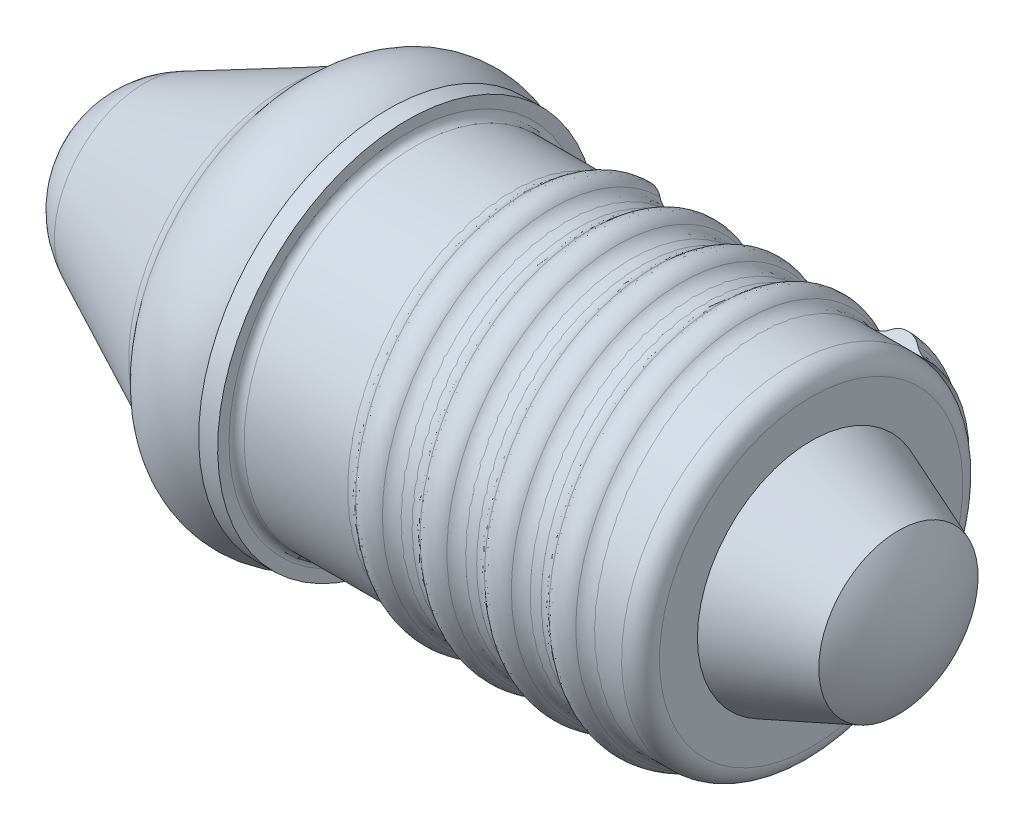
ISO-10303-21;
HEADER;
FILE_DESCRIPTION(('STEP AP214'),'2;1');
FILE_NAME('part.step','',(''),(''),'','','');
FILE_SCHEMA(('AUTOMOTIVE_DESIGN { 1 0 10303 214 1 1 1 1 }'));
ENDSEC;
DATA;
#1=APPLICATION_CONTEXT('core data for automotive mechanical design processes');
#2=APPLICATION_PROTOCOL_DEFINITION('international standard','automotive_design',2000,#1);
#3=PRODUCT_CONTEXT('',#1,'mechanical');
#4=PRODUCT('Part','Part','',(#3));
#5=PRODUCT_RELATED_PRODUCT_CATEGORY('part','',(#4));
#6=PRODUCT_DEFINITION_FORMATION('','',#4);
#7=PRODUCT_DEFINITION_CONTEXT('part definition',#1,'design');
#8=PRODUCT_DEFINITION('design','',#6,#7);
#9=PRODUCT_DEFINITION_SHAPE('','',#8);
#10=(LENGTH_UNIT() NAMED_UNIT(*) SI_UNIT(.MILLI.,.METRE.));
#11=(NAMED_UNIT(*) PLANE_ANGLE_UNIT() SI_UNIT($,.RADIAN.));
#12=(NAMED_UNIT(*) SI_UNIT($,.STERADIAN.) SOLID_ANGLE_UNIT());
#13=UNCERTAINTY_MEASURE_WITH_UNIT(LENGTH_MEASURE(1.E-05),#10,'distance_accuracy_value','');
#14=(GEOMETRIC_REPRESENTATION_CONTEXT(3) GLOBAL_UNCERTAINTY_ASSIGNED_CONTEXT((#13)) GLOBAL_UNIT_ASSIGNED_CONTEXT((#10,
#11,#12)) REPRESENTATION_CONTEXT('',''));
#15=CARTESIAN_POINT('',(0.,0.,0.));
#16=DIRECTION('',(0.,0.,1.));
#17=DIRECTION('',(1.,0.,0.));
#18=AXIS2_PLACEMENT_3D('',#15,#16,#17);
#19=CARTESIAN_POINT('',(1.87640895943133,3.56415634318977,-3.50691146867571));
#20=DIRECTION('',(-0.0580874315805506,-0.705912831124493,-0.70591283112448));
#21=DIRECTION('',(0.,0.707106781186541,-0.707106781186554));
#22=AXIS2_PLACEMENT_3D('',#19,#20,#21);
#23=PLANE('',#22);
#24=CARTESIAN_POINT('',(1.87640895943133,3.56415634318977,-3.50691146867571));
#25=DIRECTION('',(-0.0580874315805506,-0.705912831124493,-0.70591283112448));
#26=DIRECTION('',(0.,0.707106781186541,-0.707106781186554));
#27=AXIS2_PLACEMENT_3D('',#24,#25,#26);
#28=CIRCLE('',#27,0.5);
#29=CARTESIAN_POINT('',(2.22936537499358,3.29963448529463,-3.27143332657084));
#30=VERTEX_POINT('',#29);
#31=CARTESIAN_POINT('',(1.87640895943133,3.2106029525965,-3.15335807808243));
#32=VERTEX_POINT('',#31);
#33=EDGE_CURVE('E73',#30,#32,#28,.T.);
#34=ORIENTED_EDGE('',*,*,#33,.F.);
#35=CARTESIAN_POINT('',(2.58232179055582,3.0351126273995,-3.03595518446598));
#36=DIRECTION('',(0.0580874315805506,0.705912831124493,0.70591283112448));
#37=DIRECTION('',(0.,0.707106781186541,-0.707106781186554));
#38=AXIS2_PLACEMENT_3D('',#35,#36,#37);
#39=CIRCLE('',#38,0.5);
#40=CARTESIAN_POINT('',(2.93527820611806,3.27059076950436,-3.30047704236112));
#41=VERTEX_POINT('',#40);
#42=EDGE_CURVE('E78',#41,#30,#39,.T.);
#43=ORIENTED_EDGE('',*,*,#42,.F.);
#44=CARTESIAN_POINT('',(3.28823462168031,3.50606891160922,-3.56499890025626));
#45=DIRECTION('',(-0.0580874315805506,-0.705912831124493,-0.70591283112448));
#46=DIRECTION('',(0.,0.707106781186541,-0.707106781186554));
#47=AXIS2_PLACEMENT_3D('',#44,#45,#46);
#48=CIRCLE('',#47,0.5);
#49=CARTESIAN_POINT('',(3.28823462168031,3.15251552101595,-3.21144550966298));
#50=VERTEX_POINT('',#49);
#51=EDGE_CURVE('E82',#50,#41,#48,.T.);
#52=ORIENTED_EDGE('',*,*,#51,.F.);
#53=DIRECTION('',(0.998311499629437,-0.0410740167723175,-0.0410740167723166));
#54=VECTOR('',#53,1.);
#55=CARTESIAN_POINT('',(3.28823462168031,3.15251552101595,-3.21144550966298));
#56=LINE('',#55,#54);
#57=EDGE_CURVE('E85',#32,#50,#56,.T.);
#58=ORIENTED_EDGE('',*,*,#57,.F.);
#59=EDGE_LOOP('',(#34,#43,#52,#58));
#60=FACE_BOUND('',#59,.T.);
#61=ADVANCED_FACE('F41',(#60),#23,.T.);
#62=CARTESIAN_POINT('',(8.67640895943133,3.56415634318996,-3.50691146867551));
#63=DIRECTION('',(-0.0580874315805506,-0.705912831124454,-0.705912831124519));
#64=DIRECTION('',(0.,0.70710678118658,-0.707106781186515));
#65=AXIS2_PLACEMENT_3D('',#62,#63,#64);
#66=PLANE('',#65);
#67=CARTESIAN_POINT('',(8.67640895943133,3.56415634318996,-3.50691146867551));
#68=DIRECTION('',(-0.0580874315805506,-0.705912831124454,-0.705912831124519));
#69=DIRECTION('',(0.,0.70710678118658,-0.707106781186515));
#70=AXIS2_PLACEMENT_3D('',#67,#68,#69);
#71=CIRCLE('',#70,0.5);
#72=CARTESIAN_POINT('',(9.02936537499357,3.29963448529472,-3.27143332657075));
#73=VERTEX_POINT('',#72);
#74=CARTESIAN_POINT('',(8.67640895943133,3.21060295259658,-3.15335807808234));
#75=VERTEX_POINT('',#74);
#76=EDGE_CURVE('E12',#73,#75,#71,.T.);
#77=ORIENTED_EDGE('',*,*,#76,.T.);
#78=DIRECTION('',(0.998311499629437,-0.0410740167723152,-0.0410740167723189));
#79=VECTOR('',#78,1.);
#80=CARTESIAN_POINT('',(10.0882346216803,3.15251552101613,-3.2114455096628));
#81=LINE('',#80,#79);
#82=CARTESIAN_POINT('',(10.0882346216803,3.15251552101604,-3.21144550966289));
#83=VERTEX_POINT('',#82);
#84=EDGE_CURVE('E99',#75,#83,#81,.T.);
#85=ORIENTED_EDGE('',*,*,#84,.T.);
#86=CARTESIAN_POINT('',(10.0882346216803,3.50606891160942,-3.56499890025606));
#87=DIRECTION('',(-0.0580874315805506,-0.705912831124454,-0.705912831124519));
#88=DIRECTION('',(0.,0.70710678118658,-0.707106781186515));
#89=AXIS2_PLACEMENT_3D('',#86,#87,#88);
#90=CIRCLE('',#89,0.5);
#91=CARTESIAN_POINT('',(9.73527820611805,3.27059076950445,-3.30047704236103));
#92=VERTEX_POINT('',#91);
#93=EDGE_CURVE('E62',#83,#92,#90,.T.);
#94=ORIENTED_EDGE('',*,*,#93,.T.);
#95=CARTESIAN_POINT('',(9.38232179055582,3.03511262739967,-3.03595518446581));
#96=DIRECTION('',(0.0580874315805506,0.705912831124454,0.705912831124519));
#97=DIRECTION('',(0.,0.70710678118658,-0.707106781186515));
#98=AXIS2_PLACEMENT_3D('',#95,#96,#97);
#99=CIRCLE('',#98,0.5);
#100=EDGE_CURVE('E51',#92,#73,#99,.T.);
#101=ORIENTED_EDGE('',*,*,#100,.T.);
#102=EDGE_LOOP('',(#77,#85,#94,#101));
#103=FACE_BOUND('',#102,.T.);
#104=ADVANCED_FACE('F133',(#103),#66,.F.);
#105=CARTESIAN_POINT('',(1.87640895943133,3.2106029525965,-3.15335807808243));
#106=CARTESIAN_POINT('',(2.018075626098,5.03119508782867,-1.29971559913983));
#107=CARTESIAN_POINT('',(2.15974229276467,4.33618967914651,1.20378467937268));
#108=CARTESIAN_POINT('',(2.30140895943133,3.64118427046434,3.70728495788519));
#109=CARTESIAN_POINT('',(2.443075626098,1.12558672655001,4.35714275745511));
#110=CARTESIAN_POINT('',(2.58474229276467,-1.39001081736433,5.00700055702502));
#111=CARTESIAN_POINT('',(2.72640895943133,-3.2106029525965,3.15335807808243));
#112=CARTESIAN_POINT('',(2.868075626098,-5.03119508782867,1.29971559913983));
#113=CARTESIAN_POINT('',(3.00974229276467,-4.33618967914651,-1.20378467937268));
#114=CARTESIAN_POINT('',(3.15140895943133,-3.64118427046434,-3.70728495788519));
#115=CARTESIAN_POINT('',(3.293075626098,-1.12558672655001,-4.35714275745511));
#116=CARTESIAN_POINT('',(3.43474229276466,1.39001081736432,-5.00700055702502));
#117=CARTESIAN_POINT('',(3.57640895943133,3.2106029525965,-3.15335807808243));
#118=CARTESIAN_POINT('',(3.718075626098,5.03119508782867,-1.29971559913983));
#119=CARTESIAN_POINT('',(3.85974229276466,4.33618967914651,1.20378467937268));
#120=CARTESIAN_POINT('',(4.00140895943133,3.64118427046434,3.70728495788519));
#121=CARTESIAN_POINT('',(4.143075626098,1.12558672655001,4.35714275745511));
#122=CARTESIAN_POINT('',(4.28474229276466,-1.39001081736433,5.00700055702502));
#123=CARTESIAN_POINT('',(4.42640895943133,-3.2106029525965,3.15335807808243));
#124=CARTESIAN_POINT('',(4.568075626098,-5.03119508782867,1.29971559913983));
#125=CARTESIAN_POINT('',(4.70974229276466,-4.33618967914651,-1.20378467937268));
#126=CARTESIAN_POINT('',(4.85140895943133,-3.64118427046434,-3.70728495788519));
#127=CARTESIAN_POINT('',(4.99307562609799,-1.12558672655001,-4.35714275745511));
#128=CARTESIAN_POINT('',(5.13474229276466,1.39001081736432,-5.00700055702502));
#129=CARTESIAN_POINT('',(5.27640895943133,3.2106029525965,-3.15335807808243));
#130=CARTESIAN_POINT('',(5.41807562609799,5.03119508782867,-1.29971559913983));
#131=CARTESIAN_POINT('',(5.55974229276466,4.33618967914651,1.20378467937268));
#132=CARTESIAN_POINT('',(5.70140895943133,3.64118427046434,3.70728495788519));
#133=CARTESIAN_POINT('',(5.84307562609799,1.12558672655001,4.35714275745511));
#134=CARTESIAN_POINT('',(5.98474229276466,-1.39001081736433,5.00700055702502));
#135=CARTESIAN_POINT('',(6.12640895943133,-3.2106029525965,3.15335807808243));
#136=CARTESIAN_POINT('',(6.26807562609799,-5.03119508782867,1.29971559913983));
#137=CARTESIAN_POINT('',(6.40974229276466,-4.33618967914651,-1.20378467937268));
#138=CARTESIAN_POINT('',(6.55140895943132,-3.64118427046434,-3.70728495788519));
#139=CARTESIAN_POINT('',(6.69307562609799,-1.12558672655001,-4.35714275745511));
#140=CARTESIAN_POINT('',(6.83474229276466,1.39001081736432,-5.00700055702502));
#141=CARTESIAN_POINT('',(6.97640895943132,3.2106029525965,-3.15335807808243));
#142=CARTESIAN_POINT('',(7.11807562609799,5.03119508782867,-1.29971559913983));
#143=CARTESIAN_POINT('',(7.25974229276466,4.33618967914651,1.20378467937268));
#144=CARTESIAN_POINT('',(7.40140895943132,3.64118427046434,3.70728495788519));
#145=CARTESIAN_POINT('',(7.54307562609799,1.12558672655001,4.35714275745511));
#146=CARTESIAN_POINT('',(7.68474229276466,-1.39001081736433,5.00700055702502));
#147=CARTESIAN_POINT('',(7.82640895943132,-3.2106029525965,3.15335807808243));
#148=CARTESIAN_POINT('',(7.96807562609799,-5.03119508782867,1.29971559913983));
#149=CARTESIAN_POINT('',(8.10974229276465,-4.33618967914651,-1.20378467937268));
#150=CARTESIAN_POINT('',(8.25140895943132,-3.64118427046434,-3.70728495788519));
#151=CARTESIAN_POINT('',(8.39307562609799,-1.12558672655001,-4.35714275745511));
#152=CARTESIAN_POINT('',(8.53474229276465,1.39001081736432,-5.00700055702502));
#153=CARTESIAN_POINT('',(8.67640895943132,3.2106029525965,-3.15335807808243));
#154=CARTESIAN_POINT('',(3.28823462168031,3.15251552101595,-3.21144550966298));
#155=CARTESIAN_POINT('',(3.42990128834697,5.00664445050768,-1.39133982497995));
#156=CARTESIAN_POINT('',(3.57156795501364,4.35745115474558,1.12443577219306));
#157=CARTESIAN_POINT('',(3.7132346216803,3.70825785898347,3.64021136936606));
#158=CARTESIAN_POINT('',(3.85490128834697,1.20493563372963,4.33588128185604));
#159=CARTESIAN_POINT('',(3.99656795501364,-1.29838659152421,5.03155119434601));
#160=CARTESIAN_POINT('',(4.1382346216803,-3.15251552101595,3.21144550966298));
#161=CARTESIAN_POINT('',(4.27990128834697,-5.00664445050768,1.39133982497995));
#162=CARTESIAN_POINT('',(4.42156795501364,-4.35745115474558,-1.12443577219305));
#163=CARTESIAN_POINT('',(4.5632346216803,-3.70825785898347,-3.64021136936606));
#164=CARTESIAN_POINT('',(4.70490128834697,-1.20493563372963,-4.33588128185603));
#165=CARTESIAN_POINT('',(4.84656795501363,1.29838659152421,-5.03155119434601));
#166=CARTESIAN_POINT('',(4.9882346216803,3.15251552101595,-3.21144550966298));
#167=CARTESIAN_POINT('',(5.12990128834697,5.00664445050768,-1.39133982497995));
#168=CARTESIAN_POINT('',(5.27156795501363,4.35745115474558,1.12443577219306));
#169=CARTESIAN_POINT('',(5.4132346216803,3.70825785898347,3.64021136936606));
#170=CARTESIAN_POINT('',(5.55490128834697,1.20493563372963,4.33588128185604));
#171=CARTESIAN_POINT('',(5.69656795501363,-1.29838659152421,5.03155119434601));
#172=CARTESIAN_POINT('',(5.8382346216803,-3.15251552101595,3.21144550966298));
#173=CARTESIAN_POINT('',(5.97990128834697,-5.00664445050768,1.39133982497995));
#174=CARTESIAN_POINT('',(6.12156795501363,-4.35745115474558,-1.12443577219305));
#175=CARTESIAN_POINT('',(6.2632346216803,-3.70825785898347,-3.64021136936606));
#176=CARTESIAN_POINT('',(6.40490128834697,-1.20493563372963,-4.33588128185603));
#177=CARTESIAN_POINT('',(6.54656795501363,1.29838659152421,-5.03155119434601));
#178=CARTESIAN_POINT('',(6.6882346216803,3.15251552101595,-3.21144550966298));
#179=CARTESIAN_POINT('',(6.82990128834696,5.00664445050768,-1.39133982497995));
#180=CARTESIAN_POINT('',(6.97156795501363,4.35745115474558,1.12443577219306));
#181=CARTESIAN_POINT('',(7.1132346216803,3.70825785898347,3.64021136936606));
#182=CARTESIAN_POINT('',(7.25490128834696,1.20493563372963,4.33588128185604));
#183=CARTESIAN_POINT('',(7.39656795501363,-1.29838659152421,5.03155119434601));
#184=CARTESIAN_POINT('',(7.5382346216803,-3.15251552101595,3.21144550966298));
#185=CARTESIAN_POINT('',(7.67990128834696,-5.00664445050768,1.39133982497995));
#186=CARTESIAN_POINT('',(7.82156795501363,-4.35745115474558,-1.12443577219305));
#187=CARTESIAN_POINT('',(7.9632346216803,-3.70825785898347,-3.64021136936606));
#188=CARTESIAN_POINT('',(8.10490128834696,-1.20493563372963,-4.33588128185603));
#189=CARTESIAN_POINT('',(8.24656795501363,1.29838659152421,-5.03155119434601));
#190=CARTESIAN_POINT('',(8.38823462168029,3.15251552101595,-3.21144550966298));
#191=CARTESIAN_POINT('',(8.52990128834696,5.00664445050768,-1.39133982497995));
#192=CARTESIAN_POINT('',(8.67156795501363,4.35745115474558,1.12443577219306));
#193=CARTESIAN_POINT('',(8.81323462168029,3.70825785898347,3.64021136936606));
#194=CARTESIAN_POINT('',(8.95490128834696,1.20493563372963,4.33588128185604));
#195=CARTESIAN_POINT('',(9.09656795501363,-1.29838659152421,5.03155119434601));
#196=CARTESIAN_POINT('',(9.23823462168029,-3.15251552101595,3.21144550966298));
#197=CARTESIAN_POINT('',(9.37990128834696,-5.00664445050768,1.39133982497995));
#198=CARTESIAN_POINT('',(9.52156795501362,-4.35745115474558,-1.12443577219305));
#199=CARTESIAN_POINT('',(9.66323462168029,-3.70825785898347,-3.64021136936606));
#200=CARTESIAN_POINT('',(9.80490128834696,-1.20493563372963,-4.33588128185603));
#201=CARTESIAN_POINT('',(9.94656795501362,1.29838659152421,-5.03155119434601));
#202=CARTESIAN_POINT('',(10.0882346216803,3.15251552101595,-3.21144550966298));
#203=(BOUNDED_SURFACE() B_SPLINE_SURFACE(1,2,((#105,#106,#107,#108,#109,#110,#111,#112,#113,
#114,#115,#116,#117,#118,#119,#120,#121,#122,#123,#124,#125,#126,#127,#128,#129,#130,#131,#132,
#133,#134,#135,#136,#137,#138,#139,#140,#141,#142,#143,#144,#145,#146,#147,#148,#149,#150,#151,
#152,#153),(#154,#155,#156,#157,#158,#159,#160,#161,#162,#163,#164,#165,#166,#167,#168,#169,
#170,#171,#172,#173,#174,#175,#176,#177,#178,#179,#180,#181,#182,#183,#184,#185,#186,#187,#188,
#189,#190,#191,#192,#193,#194,#195,#196,#197,#198,#199,#200,#201,#202)),.UNSPECIFIED.,.F.,.F.,
.F.) B_SPLINE_SURFACE_WITH_KNOTS((2,2),(3,2,2,2,2,2,2,2,2,2,2,2,2,2,2,2,2,2,2,2,2,2,2,2,3),(0.,
1.),(0.,0.0416666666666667,0.0833333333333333,0.125,0.166666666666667,0.208333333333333,0.25,
0.291666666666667,0.333333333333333,0.375,0.416666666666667,0.458333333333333,0.5,
0.541666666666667,0.583333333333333,0.625,0.666666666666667,0.708333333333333,0.75,
0.791666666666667,0.833333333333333,0.875,0.916666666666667,0.958333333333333,1.),
.UNSPECIFIED.) GEOMETRIC_REPRESENTATION_ITEM() RATIONAL_B_SPLINE_SURFACE(((1.,0.866025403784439,
1.,0.866025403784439,1.,0.866025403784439,1.,0.866025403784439,1.,0.866025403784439,1.,
0.866025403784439,1.,0.866025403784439,1.,0.866025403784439,1.,0.866025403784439,1.,
0.866025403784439,1.,0.866025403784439,1.,0.866025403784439,1.,0.866025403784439,1.,
0.866025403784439,1.,0.866025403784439,1.,0.866025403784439,1.,0.866025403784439,1.,
0.866025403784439,1.,0.866025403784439,1.,0.866025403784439,1.,0.866025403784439,1.,
0.866025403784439,1.,0.866025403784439,1.,0.866025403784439,1.),(1.,0.866025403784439,1.,
0.866025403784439,1.,0.866025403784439,1.,0.866025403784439,1.,0.866025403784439,1.,
0.866025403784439,1.,0.866025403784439,1.,0.866025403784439,1.,0.866025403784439,1.,
0.866025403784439,1.,0.866025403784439,1.,0.866025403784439,1.,0.866025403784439,1.,
0.866025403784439,1.,0.866025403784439,1.,0.866025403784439,1.,0.866025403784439,1.,
0.866025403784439,1.,0.866025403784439,1.,0.866025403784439,1.,0.866025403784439,1.,
0.866025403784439,1.,0.866025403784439,1.,0.866025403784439,1.))) REPRESENTATION_ITEM('') SURFACE());
#204=CARTESIAN_POINT('',(3.28823462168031,3.15251552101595,-3.21144550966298));
#205=CARTESIAN_POINT('',(3.42990128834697,5.00664445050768,-1.39133982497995));
#206=CARTESIAN_POINT('',(3.57156795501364,4.35745115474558,1.12443577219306));
#207=CARTESIAN_POINT('',(3.7132346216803,3.70825785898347,3.64021136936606));
#208=CARTESIAN_POINT('',(3.85490128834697,1.20493563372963,4.33588128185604));
#209=CARTESIAN_POINT('',(3.99656795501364,-1.29838659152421,5.03155119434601));
#210=CARTESIAN_POINT('',(4.1382346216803,-3.15251552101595,3.21144550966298));
#211=CARTESIAN_POINT('',(4.27990128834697,-5.00664445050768,1.39133982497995));
#212=CARTESIAN_POINT('',(4.42156795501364,-4.35745115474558,-1.12443577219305));
#213=CARTESIAN_POINT('',(4.5632346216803,-3.70825785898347,-3.64021136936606));
#214=CARTESIAN_POINT('',(4.70490128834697,-1.20493563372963,-4.33588128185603));
#215=CARTESIAN_POINT('',(4.84656795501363,1.29838659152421,-5.03155119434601));
#216=CARTESIAN_POINT('',(4.9882346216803,3.15251552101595,-3.21144550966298));
#217=CARTESIAN_POINT('',(5.12990128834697,5.00664445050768,-1.39133982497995));
#218=CARTESIAN_POINT('',(5.27156795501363,4.35745115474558,1.12443577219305));
#219=CARTESIAN_POINT('',(5.4132346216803,3.70825785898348,3.64021136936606));
#220=CARTESIAN_POINT('',(5.55490128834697,1.20493563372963,4.33588128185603));
#221=CARTESIAN_POINT('',(5.69656795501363,-1.2983865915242,5.03155119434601));
#222=CARTESIAN_POINT('',(5.8382346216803,-3.15251552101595,3.21144550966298));
#223=CARTESIAN_POINT('',(5.97990128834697,-5.00664445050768,1.39133982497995));
#224=CARTESIAN_POINT('',(6.12156795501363,-4.35745115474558,-1.12443577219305));
#225=CARTESIAN_POINT('',(6.2632346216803,-3.70825785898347,-3.64021136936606));
#226=CARTESIAN_POINT('',(6.40490128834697,-1.20493563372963,-4.33588128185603));
#227=CARTESIAN_POINT('',(6.54656795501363,1.2983865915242,-5.03155119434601));
#228=CARTESIAN_POINT('',(6.6882346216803,3.15251552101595,-3.21144550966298));
#229=CARTESIAN_POINT('',(6.82990128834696,5.00664445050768,-1.39133982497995));
#230=CARTESIAN_POINT('',(6.97156795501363,4.35745115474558,1.12443577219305));
#231=CARTESIAN_POINT('',(7.1132346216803,3.70825785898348,3.64021136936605));
#232=CARTESIAN_POINT('',(7.25490128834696,1.20493563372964,4.33588128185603));
#233=CARTESIAN_POINT('',(7.39656795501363,-1.2983865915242,5.03155119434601));
#234=CARTESIAN_POINT('',(7.5382346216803,-3.15251552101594,3.21144550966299));
#235=CARTESIAN_POINT('',(7.67990128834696,-5.00664445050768,1.39133982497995));
#236=CARTESIAN_POINT('',(7.82156795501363,-4.35745115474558,-1.12443577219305));
#237=CARTESIAN_POINT('',(7.9632346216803,-3.70825785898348,-3.64021136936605));
#238=CARTESIAN_POINT('',(8.10490128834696,-1.20493563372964,-4.33588128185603));
#239=CARTESIAN_POINT('',(8.24656795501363,1.29838659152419,-5.03155119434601));
#240=CARTESIAN_POINT('',(8.38823462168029,3.15251552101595,-3.21144550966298));
#241=CARTESIAN_POINT('',(8.52990128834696,5.00664445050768,-1.39133982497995));
#242=CARTESIAN_POINT('',(8.67156795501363,4.35745115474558,1.12443577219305));
#243=CARTESIAN_POINT('',(8.81323462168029,3.70825785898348,3.64021136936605));
#244=CARTESIAN_POINT('',(8.95490128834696,1.20493563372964,4.33588128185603));
#245=CARTESIAN_POINT('',(9.09656795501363,-1.29838659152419,5.03155119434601));
#246=CARTESIAN_POINT('',(9.23823462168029,-3.15251552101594,3.21144550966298));
#247=CARTESIAN_POINT('',(9.37990128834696,-5.00664445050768,1.39133982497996));
#248=CARTESIAN_POINT('',(9.52156795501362,-4.35745115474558,-1.12443577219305));
#249=CARTESIAN_POINT('',(9.66323462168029,-3.70825785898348,-3.64021136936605));
#250=CARTESIAN_POINT('',(9.80490128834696,-1.20493563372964,-4.33588128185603));
#251=CARTESIAN_POINT('',(9.94656795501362,1.29838659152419,-5.03155119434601));
#252=CARTESIAN_POINT('',(10.0882346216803,3.15251552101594,-3.21144550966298));
#253=(BOUNDED_CURVE() B_SPLINE_CURVE(2,(#204,#205,#206,#207,#208,#209,#210,#211,#212,#213,#214,
#215,#216,#217,#218,#219,#220,#221,#222,#223,#224,#225,#226,#227,#228,#229,#230,#231,#232,#233,
#234,#235,#236,#237,#238,#239,#240,#241,#242,#243,#244,#245,#246,#247,#248,#249,#250,#251,#252),
.UNSPECIFIED.,.F.,.F.) B_SPLINE_CURVE_WITH_KNOTS((3,2,2,2,2,2,2,2,2,2,2,2,2,2,2,2,2,2,2,2,2,2,2,
2,3),(0.,0.0416666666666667,0.0833333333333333,0.125,0.166666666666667,0.208333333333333,0.25,
0.291666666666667,0.333333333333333,0.375,0.416666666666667,0.458333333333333,0.5,
0.541666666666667,0.583333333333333,0.625,0.666666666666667,0.708333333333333,0.75,
0.791666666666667,0.833333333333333,0.875,0.916666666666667,0.958333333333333,1.),
.UNSPECIFIED.) CURVE() GEOMETRIC_REPRESENTATION_ITEM() RATIONAL_B_SPLINE_CURVE((1.,
0.866025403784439,1.,0.866025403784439,1.,0.866025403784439,1.,0.866025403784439,1.,
0.866025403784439,1.,0.866025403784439,1.,0.866025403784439,1.,0.866025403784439,1.,
0.866025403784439,1.,0.866025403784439,1.,0.866025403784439,1.,0.866025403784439,1.,
0.866025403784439,1.,0.866025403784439,1.,0.866025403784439,1.,0.866025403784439,1.,
0.866025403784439,1.,0.866025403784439,1.,0.866025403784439,1.,0.866025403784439,1.,
0.866025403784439,1.,0.866025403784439,1.,0.866025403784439,1.,0.866025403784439,1.)) REPRESENTATION_ITEM(''));
#254=EDGE_CURVE('E100',#50,#83,#253,.T.);
#255=CARTESIAN_POINT('',(1.87640895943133,3.2106029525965,-3.15335807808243));
#256=CARTESIAN_POINT('',(2.018075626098,5.03119508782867,-1.29971559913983));
#257=CARTESIAN_POINT('',(2.15974229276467,4.33618967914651,1.20378467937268));
#258=CARTESIAN_POINT('',(2.30140895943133,3.64118427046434,3.70728495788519));
#259=CARTESIAN_POINT('',(2.443075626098,1.12558672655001,4.35714275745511));
#260=CARTESIAN_POINT('',(2.58474229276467,-1.39001081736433,5.00700055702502));
#261=CARTESIAN_POINT('',(2.72640895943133,-3.2106029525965,3.15335807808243));
#262=CARTESIAN_POINT('',(2.868075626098,-5.03119508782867,1.29971559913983));
#263=CARTESIAN_POINT('',(3.00974229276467,-4.33618967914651,-1.20378467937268));
#264=CARTESIAN_POINT('',(3.15140895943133,-3.64118427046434,-3.70728495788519));
#265=CARTESIAN_POINT('',(3.293075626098,-1.12558672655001,-4.35714275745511));
#266=CARTESIAN_POINT('',(3.43474229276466,1.39001081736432,-5.00700055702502));
#267=CARTESIAN_POINT('',(3.57640895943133,3.2106029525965,-3.15335807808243));
#268=CARTESIAN_POINT('',(3.718075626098,5.03119508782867,-1.29971559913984));
#269=CARTESIAN_POINT('',(3.85974229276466,4.33618967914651,1.20378467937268));
#270=CARTESIAN_POINT('',(4.00140895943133,3.64118427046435,3.70728495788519));
#271=CARTESIAN_POINT('',(4.143075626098,1.12558672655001,4.35714275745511));
#272=CARTESIAN_POINT('',(4.28474229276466,-1.39001081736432,5.00700055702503));
#273=CARTESIAN_POINT('',(4.42640895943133,-3.2106029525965,3.15335807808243));
#274=CARTESIAN_POINT('',(4.568075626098,-5.03119508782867,1.29971559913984));
#275=CARTESIAN_POINT('',(4.70974229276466,-4.33618967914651,-1.20378467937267));
#276=CARTESIAN_POINT('',(4.85140895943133,-3.64118427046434,-3.70728495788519));
#277=CARTESIAN_POINT('',(4.99307562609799,-1.12558672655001,-4.35714275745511));
#278=CARTESIAN_POINT('',(5.13474229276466,1.39001081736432,-5.00700055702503));
#279=CARTESIAN_POINT('',(5.27640895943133,3.2106029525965,-3.15335807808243));
#280=CARTESIAN_POINT('',(5.41807562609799,5.03119508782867,-1.29971559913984));
#281=CARTESIAN_POINT('',(5.55974229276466,4.33618967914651,1.20378467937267));
#282=CARTESIAN_POINT('',(5.70140895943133,3.64118427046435,3.70728495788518));
#283=CARTESIAN_POINT('',(5.84307562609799,1.12558672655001,4.35714275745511));
#284=CARTESIAN_POINT('',(5.98474229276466,-1.39001081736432,5.00700055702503));
#285=CARTESIAN_POINT('',(6.12640895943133,-3.21060295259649,3.15335807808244));
#286=CARTESIAN_POINT('',(6.26807562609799,-5.03119508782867,1.29971559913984));
#287=CARTESIAN_POINT('',(6.40974229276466,-4.33618967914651,-1.20378467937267));
#288=CARTESIAN_POINT('',(6.55140895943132,-3.64118427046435,-3.70728495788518));
#289=CARTESIAN_POINT('',(6.69307562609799,-1.12558672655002,-4.3571427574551));
#290=CARTESIAN_POINT('',(6.83474229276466,1.39001081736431,-5.00700055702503));
#291=CARTESIAN_POINT('',(6.97640895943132,3.2106029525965,-3.15335807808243));
#292=CARTESIAN_POINT('',(7.11807562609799,5.03119508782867,-1.29971559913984));
#293=CARTESIAN_POINT('',(7.25974229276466,4.33618967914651,1.20378467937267));
#294=CARTESIAN_POINT('',(7.40140895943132,3.64118427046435,3.70728495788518));
#295=CARTESIAN_POINT('',(7.54307562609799,1.12558672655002,4.3571427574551));
#296=CARTESIAN_POINT('',(7.68474229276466,-1.39001081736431,5.00700055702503));
#297=CARTESIAN_POINT('',(7.82640895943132,-3.2106029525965,3.15335807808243));
#298=CARTESIAN_POINT('',(7.96807562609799,-5.03119508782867,1.29971559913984));
#299=CARTESIAN_POINT('',(8.10974229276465,-4.33618967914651,-1.20378467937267));
#300=CARTESIAN_POINT('',(8.25140895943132,-3.64118427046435,-3.70728495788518));
#301=CARTESIAN_POINT('',(8.39307562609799,-1.12558672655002,-4.3571427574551));
#302=CARTESIAN_POINT('',(8.53474229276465,1.39001081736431,-5.00700055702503));
#303=CARTESIAN_POINT('',(8.67640895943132,3.2106029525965,-3.15335807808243));
#304=(BOUNDED_CURVE() B_SPLINE_CURVE(2,(#255,#256,#257,#258,#259,#260,#261,#262,#263,#264,#265,
#266,#267,#268,#269,#270,#271,#272,#273,#274,#275,#276,#277,#278,#279,#280,#281,#282,#283,#284,
#285,#286,#287,#288,#289,#290,#291,#292,#293,#294,#295,#296,#297,#298,#299,#300,#301,#302,#303),
.UNSPECIFIED.,.F.,.F.) B_SPLINE_CURVE_WITH_KNOTS((3,2,2,2,2,2,2,2,2,2,2,2,2,2,2,2,2,2,2,2,2,2,2,
2,3),(0.,0.0416666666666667,0.0833333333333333,0.125,0.166666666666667,0.208333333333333,0.25,
0.291666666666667,0.333333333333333,0.375,0.416666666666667,0.458333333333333,0.5,
0.541666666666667,0.583333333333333,0.625,0.666666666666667,0.708333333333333,0.75,
0.791666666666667,0.833333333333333,0.875,0.916666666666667,0.958333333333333,1.),
.UNSPECIFIED.) CURVE() GEOMETRIC_REPRESENTATION_ITEM() RATIONAL_B_SPLINE_CURVE((1.,
0.866025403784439,1.,0.866025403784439,1.,0.866025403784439,1.,0.866025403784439,1.,
0.866025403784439,1.,0.866025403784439,1.,0.866025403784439,1.,0.866025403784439,1.,
0.866025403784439,1.,0.866025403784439,1.,0.866025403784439,1.,0.866025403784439,1.,
0.866025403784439,1.,0.866025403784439,1.,0.866025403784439,1.,0.866025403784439,1.,
0.866025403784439,1.,0.866025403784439,1.,0.866025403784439,1.,0.866025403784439,1.,
0.866025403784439,1.,0.866025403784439,1.,0.866025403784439,1.,0.866025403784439,1.)) REPRESENTATION_ITEM(''));
#305=EDGE_CURVE('E94',#32,#75,#304,.T.);
#306=ORIENTED_EDGE('',*,*,#254,.T.);
#307=ORIENTED_EDGE('',*,*,#84,.F.);
#308=ORIENTED_EDGE('',*,*,#305,.F.);
#309=ORIENTED_EDGE('',*,*,#57,.T.);
#310=EDGE_LOOP('',(#306,#307,#308,#309));
#311=FACE_BOUND('',#310,.T.);
#312=ADVANCED_FACE('F98',(#311),#203,.T.);
#313=CARTESIAN_POINT('',(3.28823462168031,3.15251552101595,-3.21144550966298));
#314=CARTESIAN_POINT('',(3.42990128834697,5.00664445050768,-1.39133982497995));
#315=CARTESIAN_POINT('',(3.57156795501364,4.35745115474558,1.12443577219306));
#316=CARTESIAN_POINT('',(3.7132346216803,3.70825785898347,3.64021136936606));
#317=CARTESIAN_POINT('',(3.85490128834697,1.20493563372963,4.33588128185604));
#318=CARTESIAN_POINT('',(3.99656795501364,-1.29838659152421,5.03155119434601));
#319=CARTESIAN_POINT('',(4.1382346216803,-3.15251552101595,3.21144550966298));
#320=CARTESIAN_POINT('',(4.27990128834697,-5.00664445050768,1.39133982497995));
#321=CARTESIAN_POINT('',(4.42156795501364,-4.35745115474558,-1.12443577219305));
#322=CARTESIAN_POINT('',(4.5632346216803,-3.70825785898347,-3.64021136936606));
#323=CARTESIAN_POINT('',(4.70490128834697,-1.20493563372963,-4.33588128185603));
#324=CARTESIAN_POINT('',(4.84656795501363,1.29838659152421,-5.03155119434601));
#325=CARTESIAN_POINT('',(4.9882346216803,3.15251552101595,-3.21144550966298));
#326=CARTESIAN_POINT('',(5.12990128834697,5.00664445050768,-1.39133982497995));
#327=CARTESIAN_POINT('',(5.27156795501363,4.35745115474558,1.12443577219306));
#328=CARTESIAN_POINT('',(5.4132346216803,3.70825785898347,3.64021136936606));
#329=CARTESIAN_POINT('',(5.55490128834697,1.20493563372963,4.33588128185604));
#330=CARTESIAN_POINT('',(5.69656795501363,-1.29838659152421,5.03155119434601));
#331=CARTESIAN_POINT('',(5.8382346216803,-3.15251552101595,3.21144550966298));
#332=CARTESIAN_POINT('',(5.97990128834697,-5.00664445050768,1.39133982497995));
#333=CARTESIAN_POINT('',(6.12156795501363,-4.35745115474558,-1.12443577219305));
#334=CARTESIAN_POINT('',(6.2632346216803,-3.70825785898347,-3.64021136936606));
#335=CARTESIAN_POINT('',(6.40490128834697,-1.20493563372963,-4.33588128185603));
#336=CARTESIAN_POINT('',(6.54656795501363,1.29838659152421,-5.03155119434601));
#337=CARTESIAN_POINT('',(6.6882346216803,3.15251552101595,-3.21144550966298));
#338=CARTESIAN_POINT('',(6.82990128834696,5.00664445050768,-1.39133982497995));
#339=CARTESIAN_POINT('',(6.97156795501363,4.35745115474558,1.12443577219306));
#340=CARTESIAN_POINT('',(7.1132346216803,3.70825785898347,3.64021136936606));
#341=CARTESIAN_POINT('',(7.25490128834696,1.20493563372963,4.33588128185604));
#342=CARTESIAN_POINT('',(7.39656795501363,-1.29838659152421,5.03155119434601));
#343=CARTESIAN_POINT('',(7.5382346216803,-3.15251552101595,3.21144550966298));
#344=CARTESIAN_POINT('',(7.67990128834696,-5.00664445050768,1.39133982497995));
#345=CARTESIAN_POINT('',(7.82156795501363,-4.35745115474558,-1.12443577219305));
#346=CARTESIAN_POINT('',(7.9632346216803,-3.70825785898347,-3.64021136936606));
#347=CARTESIAN_POINT('',(8.10490128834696,-1.20493563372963,-4.33588128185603));
#348=CARTESIAN_POINT('',(8.24656795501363,1.29838659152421,-5.03155119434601));
#349=CARTESIAN_POINT('',(8.38823462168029,3.15251552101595,-3.21144550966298));
#350=CARTESIAN_POINT('',(8.52990128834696,5.00664445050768,-1.39133982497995));
#351=CARTESIAN_POINT('',(8.67156795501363,4.35745115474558,1.12443577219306));
#352=CARTESIAN_POINT('',(8.81323462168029,3.70825785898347,3.64021136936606));
#353=CARTESIAN_POINT('',(8.95490128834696,1.20493563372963,4.33588128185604));
#354=CARTESIAN_POINT('',(9.09656795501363,-1.29838659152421,5.03155119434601));
#355=CARTESIAN_POINT('',(9.23823462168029,-3.15251552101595,3.21144550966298));
#356=CARTESIAN_POINT('',(9.37990128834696,-5.00664445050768,1.39133982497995));
#357=CARTESIAN_POINT('',(9.52156795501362,-4.35745115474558,-1.12443577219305));
#358=CARTESIAN_POINT('',(9.66323462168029,-3.70825785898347,-3.64021136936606));
#359=CARTESIAN_POINT('',(9.80490128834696,-1.20493563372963,-4.33588128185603));
#360=CARTESIAN_POINT('',(9.94656795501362,1.29838659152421,-5.03155119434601));
#361=CARTESIAN_POINT('',(10.0882346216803,3.15251552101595,-3.21144550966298));
#362=CARTESIAN_POINT('',(3.15408097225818,3.15803507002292,-3.205925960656));
#363=CARTESIAN_POINT('',(3.29574763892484,5.00897728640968,-1.38263356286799));
#364=CARTESIAN_POINT('',(3.43741430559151,4.35543085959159,1.13197561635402));
#365=CARTESIAN_POINT('',(3.57908097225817,3.70188443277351,3.64658479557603));
#366=CARTESIAN_POINT('',(3.72074763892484,1.19739578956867,4.33790157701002));
#367=CARTESIAN_POINT('',(3.86241430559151,-1.30709285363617,5.02921835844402));
#368=CARTESIAN_POINT('',(4.00408097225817,-3.15803507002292,3.205925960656));
#369=CARTESIAN_POINT('',(4.14574763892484,-5.00897728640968,1.38263356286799));
#370=CARTESIAN_POINT('',(4.28741430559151,-4.35543085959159,-1.13197561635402));
#371=CARTESIAN_POINT('',(4.42908097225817,-3.70188443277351,-3.64658479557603));
#372=CARTESIAN_POINT('',(4.57074763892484,-1.19739578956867,-4.33790157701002));
#373=CARTESIAN_POINT('',(4.7124143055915,1.30709285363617,-5.02921835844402));
#374=CARTESIAN_POINT('',(4.85408097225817,3.15803507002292,-3.205925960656));
#375=CARTESIAN_POINT('',(4.99574763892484,5.00897728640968,-1.38263356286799));
#376=CARTESIAN_POINT('',(5.1374143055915,4.35543085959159,1.13197561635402));
#377=CARTESIAN_POINT('',(5.27908097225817,3.70188443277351,3.64658479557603));
#378=CARTESIAN_POINT('',(5.42074763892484,1.19739578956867,4.33790157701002));
#379=CARTESIAN_POINT('',(5.5624143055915,-1.30709285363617,5.02921835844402));
#380=CARTESIAN_POINT('',(5.70408097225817,-3.15803507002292,3.205925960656));
#381=CARTESIAN_POINT('',(5.84574763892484,-5.00897728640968,1.38263356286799));
#382=CARTESIAN_POINT('',(5.9874143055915,-4.35543085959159,-1.13197561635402));
#383=CARTESIAN_POINT('',(6.12908097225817,-3.70188443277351,-3.64658479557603));
#384=CARTESIAN_POINT('',(6.27074763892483,-1.19739578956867,-4.33790157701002));
#385=CARTESIAN_POINT('',(6.4124143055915,1.30709285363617,-5.02921835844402));
#386=CARTESIAN_POINT('',(6.55408097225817,3.15803507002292,-3.205925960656));
#387=CARTESIAN_POINT('',(6.69574763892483,5.00897728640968,-1.38263356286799));
#388=CARTESIAN_POINT('',(6.8374143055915,4.35543085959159,1.13197561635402));
#389=CARTESIAN_POINT('',(6.97908097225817,3.70188443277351,3.64658479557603));
#390=CARTESIAN_POINT('',(7.12074763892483,1.19739578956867,4.33790157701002));
#391=CARTESIAN_POINT('',(7.2624143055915,-1.30709285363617,5.02921835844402));
#392=CARTESIAN_POINT('',(7.40408097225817,-3.15803507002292,3.205925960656));
#393=CARTESIAN_POINT('',(7.54574763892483,-5.00897728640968,1.38263356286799));
#394=CARTESIAN_POINT('',(7.6874143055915,-4.35543085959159,-1.13197561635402));
#395=CARTESIAN_POINT('',(7.82908097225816,-3.70188443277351,-3.64658479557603));
#396=CARTESIAN_POINT('',(7.97074763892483,-1.19739578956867,-4.33790157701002));
#397=CARTESIAN_POINT('',(8.1124143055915,1.30709285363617,-5.02921835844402));
#398=CARTESIAN_POINT('',(8.25408097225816,3.15803507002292,-3.205925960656));
#399=CARTESIAN_POINT('',(8.39574763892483,5.00897728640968,-1.38263356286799));
#400=CARTESIAN_POINT('',(8.5374143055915,4.35543085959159,1.13197561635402));
#401=CARTESIAN_POINT('',(8.67908097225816,3.70188443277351,3.64658479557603));
#402=CARTESIAN_POINT('',(8.82074763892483,1.19739578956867,4.33790157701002));
#403=CARTESIAN_POINT('',(8.96241430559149,-1.30709285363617,5.02921835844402));
#404=CARTESIAN_POINT('',(9.10408097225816,-3.15803507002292,3.205925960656));
#405=CARTESIAN_POINT('',(9.24574763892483,-5.00897728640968,1.38263356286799));
#406=CARTESIAN_POINT('',(9.38741430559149,-4.35543085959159,-1.13197561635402));
#407=CARTESIAN_POINT('',(9.52908097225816,-3.70188443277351,-3.64658479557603));
#408=CARTESIAN_POINT('',(9.67074763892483,-1.19739578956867,-4.33790157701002));
#409=CARTESIAN_POINT('',(9.81241430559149,1.30709285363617,-5.02921835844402));
#410=CARTESIAN_POINT('',(9.95408097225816,3.15803507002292,-3.205925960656));
#411=CARTESIAN_POINT('',(3.03013916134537,3.19949758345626,-3.23718967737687));
#412=CARTESIAN_POINT('',(3.17180582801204,5.06848991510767,-1.38995888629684));
#413=CARTESIAN_POINT('',(3.31347249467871,4.40323728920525,1.15225134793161));
#414=CARTESIAN_POINT('',(3.45513916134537,3.73798466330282,3.69446158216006));
#415=CARTESIAN_POINT('',(3.59680582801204,1.20373970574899,4.38944102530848));
#416=CARTESIAN_POINT('',(3.7384724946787,-1.33050525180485,5.0844204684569));
#417=CARTESIAN_POINT('',(3.88013916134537,-3.19949758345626,3.23718967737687));
#418=CARTESIAN_POINT('',(4.02180582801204,-5.06848991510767,1.38995888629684));
#419=CARTESIAN_POINT('',(4.1634724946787,-4.40323728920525,-1.15225134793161));
#420=CARTESIAN_POINT('',(4.30513916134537,-3.73798466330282,-3.69446158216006));
#421=CARTESIAN_POINT('',(4.44680582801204,-1.20373970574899,-4.38944102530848));
#422=CARTESIAN_POINT('',(4.5884724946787,1.33050525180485,-5.0844204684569));
#423=CARTESIAN_POINT('',(4.73013916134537,3.19949758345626,-3.23718967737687));
#424=CARTESIAN_POINT('',(4.87180582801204,5.06848991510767,-1.38995888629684));
#425=CARTESIAN_POINT('',(5.0134724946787,4.40323728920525,1.15225134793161));
#426=CARTESIAN_POINT('',(5.15513916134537,3.73798466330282,3.69446158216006));
#427=CARTESIAN_POINT('',(5.29680582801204,1.20373970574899,4.38944102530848));
#428=CARTESIAN_POINT('',(5.4384724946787,-1.33050525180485,5.0844204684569));
#429=CARTESIAN_POINT('',(5.58013916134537,-3.19949758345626,3.23718967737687));
#430=CARTESIAN_POINT('',(5.72180582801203,-5.06848991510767,1.38995888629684));
#431=CARTESIAN_POINT('',(5.8634724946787,-4.40323728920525,-1.15225134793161));
#432=CARTESIAN_POINT('',(6.00513916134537,-3.73798466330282,-3.69446158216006));
#433=CARTESIAN_POINT('',(6.14680582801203,-1.20373970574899,-4.38944102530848));
#434=CARTESIAN_POINT('',(6.2884724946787,1.33050525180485,-5.0844204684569));
#435=CARTESIAN_POINT('',(6.43013916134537,3.19949758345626,-3.23718967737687));
#436=CARTESIAN_POINT('',(6.57180582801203,5.06848991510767,-1.38995888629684));
#437=CARTESIAN_POINT('',(6.7134724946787,4.40323728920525,1.15225134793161));
#438=CARTESIAN_POINT('',(6.85513916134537,3.73798466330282,3.69446158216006));
#439=CARTESIAN_POINT('',(6.99680582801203,1.20373970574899,4.38944102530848));
#440=CARTESIAN_POINT('',(7.1384724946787,-1.33050525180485,5.0844204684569));
#441=CARTESIAN_POINT('',(7.28013916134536,-3.19949758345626,3.23718967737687));
#442=CARTESIAN_POINT('',(7.42180582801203,-5.06848991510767,1.38995888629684));
#443=CARTESIAN_POINT('',(7.5634724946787,-4.40323728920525,-1.15225134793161));
#444=CARTESIAN_POINT('',(7.70513916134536,-3.73798466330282,-3.69446158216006));
#445=CARTESIAN_POINT('',(7.84680582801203,-1.20373970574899,-4.38944102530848));
#446=CARTESIAN_POINT('',(7.9884724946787,1.33050525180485,-5.0844204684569));
#447=CARTESIAN_POINT('',(8.13013916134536,3.19949758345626,-3.23718967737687));
#448=CARTESIAN_POINT('',(8.27180582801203,5.06848991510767,-1.38995888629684));
#449=CARTESIAN_POINT('',(8.41347249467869,4.40323728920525,1.15225134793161));
#450=CARTESIAN_POINT('',(8.55513916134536,3.73798466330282,3.69446158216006));
#451=CARTESIAN_POINT('',(8.69680582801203,1.20373970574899,4.38944102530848));
#452=CARTESIAN_POINT('',(8.83847249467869,-1.33050525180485,5.0844204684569));
#453=CARTESIAN_POINT('',(8.98013916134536,-3.19949758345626,3.23718967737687));
#454=CARTESIAN_POINT('',(9.12180582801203,-5.06848991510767,1.38995888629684));
#455=CARTESIAN_POINT('',(9.26347249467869,-4.40323728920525,-1.15225134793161));
#456=CARTESIAN_POINT('',(9.40513916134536,-3.73798466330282,-3.69446158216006));
#457=CARTESIAN_POINT('',(9.54680582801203,-1.20373970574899,-4.38944102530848));
#458=CARTESIAN_POINT('',(9.68847249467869,1.33050525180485,-5.0844204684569));
#459=CARTESIAN_POINT('',(9.83013916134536,3.19949758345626,-3.23718967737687));
#460=CARTESIAN_POINT('',(2.93527820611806,3.27059076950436,-3.30047704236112));
#461=CARTESIAN_POINT('',(3.07694487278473,5.17612207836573,-1.41220058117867));
#462=CARTESIAN_POINT('',(3.2186115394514,4.49359234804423,1.18217617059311));
#463=CARTESIAN_POINT('',(3.36027820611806,3.81106261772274,3.77655292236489));
#464=CARTESIAN_POINT('',(3.50194487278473,1.22300157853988,4.48265321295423));
#465=CARTESIAN_POINT('',(3.64361153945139,-1.36505946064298,5.18875350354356));
#466=CARTESIAN_POINT('',(3.78527820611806,-3.27059076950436,3.30047704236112));
#467=CARTESIAN_POINT('',(3.92694487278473,-5.17612207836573,1.41220058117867));
#468=CARTESIAN_POINT('',(4.06861153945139,-4.49359234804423,-1.18217617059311));
#469=CARTESIAN_POINT('',(4.21027820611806,-3.81106261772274,-3.77655292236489));
#470=CARTESIAN_POINT('',(4.35194487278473,-1.22300157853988,-4.48265321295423));
#471=CARTESIAN_POINT('',(4.49361153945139,1.36505946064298,-5.18875350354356));
#472=CARTESIAN_POINT('',(4.63527820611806,3.27059076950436,-3.30047704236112));
#473=CARTESIAN_POINT('',(4.77694487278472,5.17612207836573,-1.41220058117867));
#474=CARTESIAN_POINT('',(4.91861153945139,4.49359234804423,1.18217617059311));
#475=CARTESIAN_POINT('',(5.06027820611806,3.81106261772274,3.77655292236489));
#476=CARTESIAN_POINT('',(5.20194487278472,1.22300157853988,4.48265321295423));
#477=CARTESIAN_POINT('',(5.34361153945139,-1.36505946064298,5.18875350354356));
#478=CARTESIAN_POINT('',(5.48527820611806,-3.27059076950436,3.30047704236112));
#479=CARTESIAN_POINT('',(5.62694487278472,-5.17612207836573,1.41220058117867));
#480=CARTESIAN_POINT('',(5.76861153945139,-4.49359234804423,-1.18217617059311));
#481=CARTESIAN_POINT('',(5.91027820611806,-3.81106261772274,-3.77655292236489));
#482=CARTESIAN_POINT('',(6.05194487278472,-1.22300157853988,-4.48265321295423));
#483=CARTESIAN_POINT('',(6.19361153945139,1.36505946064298,-5.18875350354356));
#484=CARTESIAN_POINT('',(6.33527820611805,3.27059076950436,-3.30047704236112));
#485=CARTESIAN_POINT('',(6.47694487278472,5.17612207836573,-1.41220058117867));
#486=CARTESIAN_POINT('',(6.61861153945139,4.49359234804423,1.18217617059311));
#487=CARTESIAN_POINT('',(6.76027820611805,3.81106261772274,3.77655292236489));
#488=CARTESIAN_POINT('',(6.90194487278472,1.22300157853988,4.48265321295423));
#489=CARTESIAN_POINT('',(7.04361153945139,-1.36505946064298,5.18875350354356));
#490=CARTESIAN_POINT('',(7.18527820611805,-3.27059076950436,3.30047704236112));
#491=CARTESIAN_POINT('',(7.32694487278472,-5.17612207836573,1.41220058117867));
#492=CARTESIAN_POINT('',(7.46861153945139,-4.49359234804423,-1.18217617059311));
#493=CARTESIAN_POINT('',(7.61027820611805,-3.81106261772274,-3.77655292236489));
#494=CARTESIAN_POINT('',(7.75194487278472,-1.22300157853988,-4.48265321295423));
#495=CARTESIAN_POINT('',(7.89361153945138,1.36505946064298,-5.18875350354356));
#496=CARTESIAN_POINT('',(8.03527820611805,3.27059076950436,-3.30047704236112));
#497=CARTESIAN_POINT('',(8.17694487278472,5.17612207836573,-1.41220058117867));
#498=CARTESIAN_POINT('',(8.31861153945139,4.49359234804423,1.18217617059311));
#499=CARTESIAN_POINT('',(8.46027820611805,3.81106261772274,3.77655292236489));
#500=CARTESIAN_POINT('',(8.60194487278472,1.22300157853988,4.48265321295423));
#501=CARTESIAN_POINT('',(8.74361153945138,-1.36505946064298,5.18875350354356));
#502=CARTESIAN_POINT('',(8.88527820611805,-3.27059076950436,3.30047704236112));
#503=CARTESIAN_POINT('',(9.02694487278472,-5.17612207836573,1.41220058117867));
#504=CARTESIAN_POINT('',(9.16861153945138,-4.49359234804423,-1.18217617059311));
#505=CARTESIAN_POINT('',(9.31027820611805,-3.81106261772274,-3.77655292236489));
#506=CARTESIAN_POINT('',(9.45194487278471,-1.22300157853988,-4.48265321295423));
#507=CARTESIAN_POINT('',(9.59361153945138,1.36505946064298,-5.18875350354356));
#508=CARTESIAN_POINT('',(9.73527820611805,3.27059076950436,-3.30047704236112));
#509=(BOUNDED_SURFACE() B_SPLINE_SURFACE(3,2,((#313,#314,#315,#316,#317,#318,#319,#320,#321,
#322,#323,#324,#325,#326,#327,#328,#329,#330,#331,#332,#333,#334,#335,#336,#337,#338,#339,#340,
#341,#342,#343,#344,#345,#346,#347,#348,#349,#350,#351,#352,#353,#354,#355,#356,#357,#358,#359,
#360,#361),(#362,#363,#364,#365,#366,#367,#368,#369,#370,#371,#372,#373,#374,#375,#376,#377,
#378,#379,#380,#381,#382,#383,#384,#385,#386,#387,#388,#389,#390,#391,#392,#393,#394,#395,#396,
#397,#398,#399,#400,#401,#402,#403,#404,#405,#406,#407,#408,#409,#410),(#411,#412,#413,#414,
#415,#416,#417,#418,#419,#420,#421,#422,#423,#424,#425,#426,#427,#428,#429,#430,#431,#432,#433,
#434,#435,#436,#437,#438,#439,#440,#441,#442,#443,#444,#445,#446,#447,#448,#449,#450,#451,#452,
#453,#454,#455,#456,#457,#458,#459),(#460,#461,#462,#463,#464,#465,#466,#467,#468,#469,#470,
#471,#472,#473,#474,#475,#476,#477,#478,#479,#480,#481,#482,#483,#484,#485,#486,#487,#488,#489,
#490,#491,#492,#493,#494,#495,#496,#497,#498,#499,#500,#501,#502,#503,#504,#505,#506,#507,
#508)),.UNSPECIFIED.,.F.,.F.,.F.) B_SPLINE_SURFACE_WITH_KNOTS((4,4),(3,2,2,2,2,2,2,2,2,2,2,2,2,
2,2,2,2,2,2,2,2,2,2,2,3),(0.,1.),(0.,0.0416666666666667,0.0833333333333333,0.125,
0.166666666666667,0.208333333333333,0.25,0.291666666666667,0.333333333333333,0.375,
0.416666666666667,0.458333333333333,0.5,0.541666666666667,0.583333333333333,0.625,
0.666666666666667,0.708333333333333,0.75,0.791666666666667,0.833333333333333,0.875,
0.916666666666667,0.958333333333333,1.),
.UNSPECIFIED.) GEOMETRIC_REPRESENTATION_ITEM() RATIONAL_B_SPLINE_SURFACE(((1.,0.866025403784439,
1.,0.866025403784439,1.,0.866025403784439,1.,0.866025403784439,1.,0.866025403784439,1.,
0.866025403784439,1.,0.866025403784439,1.,0.866025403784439,1.,0.866025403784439,1.,
0.866025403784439,1.,0.866025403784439,1.,0.866025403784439,1.,0.866025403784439,1.,
0.866025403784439,1.,0.866025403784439,1.,0.866025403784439,1.,0.866025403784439,1.,
0.866025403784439,1.,0.866025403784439,1.,0.866025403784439,1.,0.866025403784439,1.,
0.866025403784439,1.,0.866025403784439,1.,0.866025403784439,1.),(0.949253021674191,
0.82207723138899,0.949253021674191,0.82207723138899,0.949253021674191,0.82207723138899,
0.949253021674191,0.82207723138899,0.949253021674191,0.82207723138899,0.949253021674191,
0.82207723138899,0.949253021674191,0.82207723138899,0.949253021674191,0.82207723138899,
0.949253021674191,0.82207723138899,0.949253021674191,0.82207723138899,0.949253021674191,
0.82207723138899,0.949253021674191,0.82207723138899,0.949253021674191,0.82207723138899,
0.949253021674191,0.82207723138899,0.949253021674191,0.82207723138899,0.949253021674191,
0.82207723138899,0.949253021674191,0.82207723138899,0.949253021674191,0.82207723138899,
0.949253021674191,0.82207723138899,0.949253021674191,0.82207723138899,0.949253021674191,
0.82207723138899,0.949253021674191,0.82207723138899,0.949253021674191,0.82207723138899,
0.949253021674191,0.82207723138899,0.949253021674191),(0.949253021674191,0.82207723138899,
0.949253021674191,0.82207723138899,0.949253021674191,0.82207723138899,0.949253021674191,
0.82207723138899,0.949253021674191,0.82207723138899,0.949253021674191,0.82207723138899,
0.949253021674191,0.82207723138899,0.949253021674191,0.82207723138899,0.949253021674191,
0.82207723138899,0.949253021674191,0.82207723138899,0.949253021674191,0.82207723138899,
0.949253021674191,0.82207723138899,0.949253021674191,0.82207723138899,0.949253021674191,
0.82207723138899,0.949253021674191,0.82207723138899,0.949253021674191,0.82207723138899,
0.949253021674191,0.82207723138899,0.949253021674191,0.82207723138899,0.949253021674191,
0.82207723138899,0.949253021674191,0.82207723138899,0.949253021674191,0.82207723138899,
0.949253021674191,0.82207723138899,0.949253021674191,0.82207723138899,0.949253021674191,
0.82207723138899,0.949253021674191),(1.,0.866025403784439,1.,0.866025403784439,1.,
0.866025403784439,1.,0.866025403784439,1.,0.866025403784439,1.,0.866025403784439,1.,
0.866025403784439,1.,0.866025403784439,1.,0.866025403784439,1.,0.866025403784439,1.,
0.866025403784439,1.,0.866025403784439,1.,0.866025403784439,1.,0.866025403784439,1.,
0.866025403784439,1.,0.866025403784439,1.,0.866025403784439,1.,0.866025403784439,1.,
0.866025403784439,1.,0.866025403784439,1.,0.866025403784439,1.,0.866025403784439,1.,
0.866025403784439,1.,0.866025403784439,1.))) REPRESENTATION_ITEM('') SURFACE());
#510=CARTESIAN_POINT('',(2.93527820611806,3.27059076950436,-3.30047704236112));
#511=CARTESIAN_POINT('',(3.07694487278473,5.17612207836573,-1.41220058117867));
#512=CARTESIAN_POINT('',(3.21861153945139,4.49359234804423,1.18217617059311));
#513=CARTESIAN_POINT('',(3.36027820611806,3.81106261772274,3.77655292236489));
#514=CARTESIAN_POINT('',(3.50194487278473,1.22300157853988,4.48265321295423));
#515=CARTESIAN_POINT('',(3.64361153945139,-1.36505946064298,5.18875350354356));
#516=CARTESIAN_POINT('',(3.78527820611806,-3.27059076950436,3.30047704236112));
#517=CARTESIAN_POINT('',(3.92694487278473,-5.17612207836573,1.41220058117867));
#518=CARTESIAN_POINT('',(4.06861153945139,-4.49359234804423,-1.18217617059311));
#519=CARTESIAN_POINT('',(4.21027820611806,-3.81106261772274,-3.77655292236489));
#520=CARTESIAN_POINT('',(4.35194487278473,-1.22300157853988,-4.48265321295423));
#521=CARTESIAN_POINT('',(4.49361153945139,1.36505946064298,-5.18875350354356));
#522=CARTESIAN_POINT('',(4.63527820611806,3.27059076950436,-3.30047704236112));
#523=CARTESIAN_POINT('',(4.77694487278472,5.17612207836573,-1.41220058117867));
#524=CARTESIAN_POINT('',(4.91861153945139,4.49359234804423,1.18217617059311));
#525=CARTESIAN_POINT('',(5.06027820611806,3.81106261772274,3.77655292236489));
#526=CARTESIAN_POINT('',(5.20194487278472,1.22300157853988,4.48265321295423));
#527=CARTESIAN_POINT('',(5.34361153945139,-1.36505946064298,5.18875350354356));
#528=CARTESIAN_POINT('',(5.48527820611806,-3.27059076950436,3.30047704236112));
#529=CARTESIAN_POINT('',(5.62694487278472,-5.17612207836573,1.41220058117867));
#530=CARTESIAN_POINT('',(5.76861153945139,-4.49359234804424,-1.1821761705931));
#531=CARTESIAN_POINT('',(5.91027820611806,-3.81106261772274,-3.77655292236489));
#532=CARTESIAN_POINT('',(6.05194487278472,-1.22300157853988,-4.48265321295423));
#533=CARTESIAN_POINT('',(6.19361153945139,1.36505946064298,-5.18875350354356));
#534=CARTESIAN_POINT('',(6.33527820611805,3.27059076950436,-3.30047704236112));
#535=CARTESIAN_POINT('',(6.47694487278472,5.17612207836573,-1.41220058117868));
#536=CARTESIAN_POINT('',(6.61861153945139,4.49359234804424,1.1821761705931));
#537=CARTESIAN_POINT('',(6.76027820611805,3.81106261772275,3.77655292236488));
#538=CARTESIAN_POINT('',(6.90194487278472,1.22300157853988,4.48265321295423));
#539=CARTESIAN_POINT('',(7.04361153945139,-1.36505946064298,5.18875350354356));
#540=CARTESIAN_POINT('',(7.18527820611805,-3.27059076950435,3.30047704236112));
#541=CARTESIAN_POINT('',(7.32694487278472,-5.17612207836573,1.41220058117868));
#542=CARTESIAN_POINT('',(7.46861153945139,-4.49359234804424,-1.1821761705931));
#543=CARTESIAN_POINT('',(7.61027820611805,-3.81106261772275,-3.77655292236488));
#544=CARTESIAN_POINT('',(7.75194487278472,-1.22300157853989,-4.48265321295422));
#545=CARTESIAN_POINT('',(7.89361153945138,1.36505946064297,-5.18875350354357));
#546=CARTESIAN_POINT('',(8.03527820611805,3.27059076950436,-3.30047704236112));
#547=CARTESIAN_POINT('',(8.17694487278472,5.17612207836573,-1.41220058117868));
#548=CARTESIAN_POINT('',(8.31861153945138,4.49359234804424,1.1821761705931));
#549=CARTESIAN_POINT('',(8.46027820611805,3.81106261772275,3.77655292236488));
#550=CARTESIAN_POINT('',(8.60194487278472,1.22300157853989,4.48265321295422));
#551=CARTESIAN_POINT('',(8.74361153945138,-1.36505946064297,5.18875350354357));
#552=CARTESIAN_POINT('',(8.88527820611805,-3.27059076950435,3.30047704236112));
#553=CARTESIAN_POINT('',(9.02694487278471,-5.17612207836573,1.41220058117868));
#554=CARTESIAN_POINT('',(9.16861153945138,-4.49359234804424,-1.1821761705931));
#555=CARTESIAN_POINT('',(9.31027820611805,-3.81106261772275,-3.77655292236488));
#556=CARTESIAN_POINT('',(9.45194487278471,-1.22300157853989,-4.48265321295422));
#557=CARTESIAN_POINT('',(9.59361153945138,1.36505946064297,-5.18875350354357));
#558=CARTESIAN_POINT('',(9.73527820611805,3.27059076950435,-3.30047704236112));
#559=(BOUNDED_CURVE() B_SPLINE_CURVE(2,(#510,#511,#512,#513,#514,#515,#516,#517,#518,#519,#520,
#521,#522,#523,#524,#525,#526,#527,#528,#529,#530,#531,#532,#533,#534,#535,#536,#537,#538,#539,
#540,#541,#542,#543,#544,#545,#546,#547,#548,#549,#550,#551,#552,#553,#554,#555,#556,#557,#558),
.UNSPECIFIED.,.F.,.F.) B_SPLINE_CURVE_WITH_KNOTS((3,2,2,2,2,2,2,2,2,2,2,2,2,2,2,2,2,2,2,2,2,2,2,
2,3),(0.,0.0416666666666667,0.0833333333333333,0.125,0.166666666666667,0.208333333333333,0.25,
0.291666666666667,0.333333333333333,0.375,0.416666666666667,0.458333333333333,0.5,
0.541666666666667,0.583333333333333,0.625,0.666666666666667,0.708333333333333,0.75,
0.791666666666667,0.833333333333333,0.875,0.916666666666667,0.958333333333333,1.),
.UNSPECIFIED.) CURVE() GEOMETRIC_REPRESENTATION_ITEM() RATIONAL_B_SPLINE_CURVE((1.,
0.866025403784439,1.,0.866025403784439,1.,0.866025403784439,1.,0.866025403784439,1.,
0.866025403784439,1.,0.866025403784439,1.,0.866025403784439,1.,0.866025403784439,1.,
0.866025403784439,1.,0.866025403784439,1.,0.866025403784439,1.,0.866025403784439,1.,
0.866025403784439,1.,0.866025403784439,1.,0.866025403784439,1.,0.866025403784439,1.,
0.866025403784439,1.,0.866025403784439,1.,0.866025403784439,1.,0.866025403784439,1.,
0.866025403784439,1.,0.866025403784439,1.,0.866025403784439,1.,0.866025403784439,1.)) REPRESENTATION_ITEM(''));
#560=EDGE_CURVE('E102',#41,#92,#559,.T.);
#561=ORIENTED_EDGE('',*,*,#560,.T.);
#562=ORIENTED_EDGE('',*,*,#93,.F.);
#563=ORIENTED_EDGE('',*,*,#254,.F.);
#564=ORIENTED_EDGE('',*,*,#51,.T.);
#565=EDGE_LOOP('',(#561,#562,#563,#564));
#566=FACE_BOUND('',#565,.T.);
#567=ADVANCED_FACE('F135',(#566),#509,.T.);
#568=CARTESIAN_POINT('',(2.93527820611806,3.27059076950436,-3.30047704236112));
#569=CARTESIAN_POINT('',(3.07694487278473,5.17612207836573,-1.41220058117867));
#570=CARTESIAN_POINT('',(3.2186115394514,4.49359234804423,1.18217617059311));
#571=CARTESIAN_POINT('',(3.36027820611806,3.81106261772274,3.77655292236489));
#572=CARTESIAN_POINT('',(3.50194487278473,1.22300157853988,4.48265321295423));
#573=CARTESIAN_POINT('',(3.64361153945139,-1.36505946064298,5.18875350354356));
#574=CARTESIAN_POINT('',(3.78527820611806,-3.27059076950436,3.30047704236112));
#575=CARTESIAN_POINT('',(3.92694487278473,-5.17612207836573,1.41220058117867));
#576=CARTESIAN_POINT('',(4.06861153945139,-4.49359234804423,-1.18217617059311));
#577=CARTESIAN_POINT('',(4.21027820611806,-3.81106261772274,-3.77655292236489));
#578=CARTESIAN_POINT('',(4.35194487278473,-1.22300157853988,-4.48265321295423));
#579=CARTESIAN_POINT('',(4.49361153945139,1.36505946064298,-5.18875350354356));
#580=CARTESIAN_POINT('',(4.63527820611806,3.27059076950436,-3.30047704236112));
#581=CARTESIAN_POINT('',(4.77694487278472,5.17612207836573,-1.41220058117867));
#582=CARTESIAN_POINT('',(4.91861153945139,4.49359234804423,1.18217617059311));
#583=CARTESIAN_POINT('',(5.06027820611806,3.81106261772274,3.77655292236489));
#584=CARTESIAN_POINT('',(5.20194487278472,1.22300157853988,4.48265321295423));
#585=CARTESIAN_POINT('',(5.34361153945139,-1.36505946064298,5.18875350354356));
#586=CARTESIAN_POINT('',(5.48527820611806,-3.27059076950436,3.30047704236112));
#587=CARTESIAN_POINT('',(5.62694487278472,-5.17612207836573,1.41220058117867));
#588=CARTESIAN_POINT('',(5.76861153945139,-4.49359234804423,-1.18217617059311));
#589=CARTESIAN_POINT('',(5.91027820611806,-3.81106261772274,-3.77655292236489));
#590=CARTESIAN_POINT('',(6.05194487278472,-1.22300157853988,-4.48265321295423));
#591=CARTESIAN_POINT('',(6.19361153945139,1.36505946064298,-5.18875350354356));
#592=CARTESIAN_POINT('',(6.33527820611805,3.27059076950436,-3.30047704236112));
#593=CARTESIAN_POINT('',(6.47694487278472,5.17612207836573,-1.41220058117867));
#594=CARTESIAN_POINT('',(6.61861153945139,4.49359234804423,1.18217617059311));
#595=CARTESIAN_POINT('',(6.76027820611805,3.81106261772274,3.77655292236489));
#596=CARTESIAN_POINT('',(6.90194487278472,1.22300157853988,4.48265321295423));
#597=CARTESIAN_POINT('',(7.04361153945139,-1.36505946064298,5.18875350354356));
#598=CARTESIAN_POINT('',(7.18527820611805,-3.27059076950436,3.30047704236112));
#599=CARTESIAN_POINT('',(7.32694487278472,-5.17612207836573,1.41220058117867));
#600=CARTESIAN_POINT('',(7.46861153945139,-4.49359234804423,-1.18217617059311));
#601=CARTESIAN_POINT('',(7.61027820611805,-3.81106261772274,-3.77655292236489));
#602=CARTESIAN_POINT('',(7.75194487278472,-1.22300157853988,-4.48265321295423));
#603=CARTESIAN_POINT('',(7.89361153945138,1.36505946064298,-5.18875350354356));
#604=CARTESIAN_POINT('',(8.03527820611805,3.27059076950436,-3.30047704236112));
#605=CARTESIAN_POINT('',(8.17694487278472,5.17612207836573,-1.41220058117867));
#606=CARTESIAN_POINT('',(8.31861153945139,4.49359234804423,1.18217617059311));
#607=CARTESIAN_POINT('',(8.46027820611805,3.81106261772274,3.77655292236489));
#608=CARTESIAN_POINT('',(8.60194487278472,1.22300157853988,4.48265321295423));
#609=CARTESIAN_POINT('',(8.74361153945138,-1.36505946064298,5.18875350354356));
#610=CARTESIAN_POINT('',(8.88527820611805,-3.27059076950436,3.30047704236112));
#611=CARTESIAN_POINT('',(9.02694487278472,-5.17612207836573,1.41220058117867));
#612=CARTESIAN_POINT('',(9.16861153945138,-4.49359234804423,-1.18217617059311));
#613=CARTESIAN_POINT('',(9.31027820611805,-3.81106261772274,-3.77655292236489));
#614=CARTESIAN_POINT('',(9.45194487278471,-1.22300157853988,-4.48265321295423));
#615=CARTESIAN_POINT('',(9.59361153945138,1.36505946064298,-5.18875350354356));
#616=CARTESIAN_POINT('',(9.73527820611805,3.27059076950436,-3.30047704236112));
#617=CARTESIAN_POINT('',(2.7285211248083,3.4255440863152,-3.43841694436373));
#618=CARTESIAN_POINT('',(2.87018779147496,5.41071503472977,-1.46067814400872));
#619=CARTESIAN_POINT('',(3.01185445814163,4.69052846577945,1.24739972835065));
#620=CARTESIAN_POINT('',(3.15352112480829,3.97034189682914,3.95547760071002));
#621=CARTESIAN_POINT('',(3.29518779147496,1.26498437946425,4.68581667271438));
#622=CARTESIAN_POINT('',(3.43685445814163,-1.44037313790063,5.41615574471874));
#623=CARTESIAN_POINT('',(3.57852112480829,-3.4255440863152,3.43841694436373));
#624=CARTESIAN_POINT('',(3.72018779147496,-5.41071503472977,1.46067814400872));
#625=CARTESIAN_POINT('',(3.86185445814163,-4.69052846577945,-1.24739972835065));
#626=CARTESIAN_POINT('',(4.00352112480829,-3.97034189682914,-3.95547760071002));
#627=CARTESIAN_POINT('',(4.14518779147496,-1.26498437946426,-4.68581667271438));
#628=CARTESIAN_POINT('',(4.28685445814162,1.44037313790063,-5.41615574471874));
#629=CARTESIAN_POINT('',(4.42852112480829,3.4255440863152,-3.43841694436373));
#630=CARTESIAN_POINT('',(4.57018779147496,5.41071503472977,-1.46067814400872));
#631=CARTESIAN_POINT('',(4.71185445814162,4.69052846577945,1.24739972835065));
#632=CARTESIAN_POINT('',(4.85352112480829,3.97034189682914,3.95547760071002));
#633=CARTESIAN_POINT('',(4.99518779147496,1.26498437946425,4.68581667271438));
#634=CARTESIAN_POINT('',(5.13685445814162,-1.44037313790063,5.41615574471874));
#635=CARTESIAN_POINT('',(5.27852112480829,-3.4255440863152,3.43841694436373));
#636=CARTESIAN_POINT('',(5.42018779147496,-5.41071503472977,1.46067814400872));
#637=CARTESIAN_POINT('',(5.56185445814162,-4.69052846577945,-1.24739972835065));
#638=CARTESIAN_POINT('',(5.70352112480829,-3.97034189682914,-3.95547760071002));
#639=CARTESIAN_POINT('',(5.84518779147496,-1.26498437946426,-4.68581667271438));
#640=CARTESIAN_POINT('',(5.98685445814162,1.44037313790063,-5.41615574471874));
#641=CARTESIAN_POINT('',(6.12852112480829,3.4255440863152,-3.43841694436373));
#642=CARTESIAN_POINT('',(6.27018779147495,5.41071503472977,-1.46067814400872));
#643=CARTESIAN_POINT('',(6.41185445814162,4.69052846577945,1.24739972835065));
#644=CARTESIAN_POINT('',(6.55352112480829,3.97034189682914,3.95547760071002));
#645=CARTESIAN_POINT('',(6.69518779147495,1.26498437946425,4.68581667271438));
#646=CARTESIAN_POINT('',(6.83685445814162,-1.44037313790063,5.41615574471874));
#647=CARTESIAN_POINT('',(6.97852112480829,-3.4255440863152,3.43841694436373));
#648=CARTESIAN_POINT('',(7.12018779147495,-5.41071503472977,1.46067814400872));
#649=CARTESIAN_POINT('',(7.26185445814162,-4.69052846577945,-1.24739972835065));
#650=CARTESIAN_POINT('',(7.40352112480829,-3.97034189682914,-3.95547760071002));
#651=CARTESIAN_POINT('',(7.54518779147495,-1.26498437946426,-4.68581667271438));
#652=CARTESIAN_POINT('',(7.68685445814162,1.44037313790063,-5.41615574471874));
#653=CARTESIAN_POINT('',(7.82852112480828,3.4255440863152,-3.43841694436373));
#654=CARTESIAN_POINT('',(7.97018779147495,5.41071503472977,-1.46067814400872));
#655=CARTESIAN_POINT('',(8.11185445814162,4.69052846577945,1.24739972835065));
#656=CARTESIAN_POINT('',(8.25352112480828,3.97034189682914,3.95547760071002));
#657=CARTESIAN_POINT('',(8.39518779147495,1.26498437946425,4.68581667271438));
#658=CARTESIAN_POINT('',(8.53685445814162,-1.44037313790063,5.41615574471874));
#659=CARTESIAN_POINT('',(8.67852112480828,-3.4255440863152,3.43841694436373));
#660=CARTESIAN_POINT('',(8.82018779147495,-5.41071503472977,1.46067814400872));
#661=CARTESIAN_POINT('',(8.96185445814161,-4.69052846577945,-1.24739972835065));
#662=CARTESIAN_POINT('',(9.10352112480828,-3.97034189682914,-3.95547760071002));
#663=CARTESIAN_POINT('',(9.24518779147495,-1.26498437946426,-4.68581667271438));
#664=CARTESIAN_POINT('',(9.38685445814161,1.44037313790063,-5.41615574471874));
#665=CARTESIAN_POINT('',(9.52852112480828,3.4255440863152,-3.43841694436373));
#666=CARTESIAN_POINT('',(2.43612245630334,3.43757438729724,-3.42638664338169));
#667=CARTESIAN_POINT('',(2.57778912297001,5.4157996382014,-1.44170214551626));
#668=CARTESIAN_POINT('',(2.71945578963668,4.68612507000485,1.26383342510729));
#669=CARTESIAN_POINT('',(2.86112245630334,3.95645050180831,3.96936899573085));
#670=CARTESIAN_POINT('',(3.00278912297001,1.24855068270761,4.69022006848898));
#671=CARTESIAN_POINT('',(3.14445578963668,-1.45934913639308,5.41107114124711));
#672=CARTESIAN_POINT('',(3.28612245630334,-3.43757438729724,3.42638664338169));
#673=CARTESIAN_POINT('',(3.42778912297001,-5.41579963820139,1.44170214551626));
#674=CARTESIAN_POINT('',(3.56945578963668,-4.68612507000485,-1.26383342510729));
#675=CARTESIAN_POINT('',(3.71112245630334,-3.95645050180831,-3.96936899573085));
#676=CARTESIAN_POINT('',(3.85278912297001,-1.24855068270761,-4.69022006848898));
#677=CARTESIAN_POINT('',(3.99445578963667,1.45934913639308,-5.41107114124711));
#678=CARTESIAN_POINT('',(4.13612245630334,3.43757438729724,-3.42638664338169));
#679=CARTESIAN_POINT('',(4.27778912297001,5.4157996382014,-1.44170214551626));
#680=CARTESIAN_POINT('',(4.41945578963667,4.68612507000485,1.26383342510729));
#681=CARTESIAN_POINT('',(4.56112245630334,3.95645050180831,3.96936899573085));
#682=CARTESIAN_POINT('',(4.70278912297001,1.24855068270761,4.69022006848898));
#683=CARTESIAN_POINT('',(4.84445578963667,-1.45934913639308,5.41107114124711));
#684=CARTESIAN_POINT('',(4.98612245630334,-3.43757438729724,3.42638664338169));
#685=CARTESIAN_POINT('',(5.12778912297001,-5.41579963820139,1.44170214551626));
#686=CARTESIAN_POINT('',(5.26945578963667,-4.68612507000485,-1.26383342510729));
#687=CARTESIAN_POINT('',(5.41112245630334,-3.95645050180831,-3.96936899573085));
#688=CARTESIAN_POINT('',(5.55278912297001,-1.24855068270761,-4.69022006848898));
#689=CARTESIAN_POINT('',(5.69445578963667,1.45934913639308,-5.41107114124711));
#690=CARTESIAN_POINT('',(5.83612245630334,3.43757438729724,-3.42638664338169));
#691=CARTESIAN_POINT('',(5.97778912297,5.4157996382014,-1.44170214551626));
#692=CARTESIAN_POINT('',(6.11945578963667,4.68612507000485,1.26383342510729));
#693=CARTESIAN_POINT('',(6.26112245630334,3.95645050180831,3.96936899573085));
#694=CARTESIAN_POINT('',(6.40278912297,1.24855068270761,4.69022006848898));
#695=CARTESIAN_POINT('',(6.54445578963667,-1.45934913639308,5.41107114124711));
#696=CARTESIAN_POINT('',(6.68612245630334,-3.43757438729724,3.42638664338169));
#697=CARTESIAN_POINT('',(6.82778912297,-5.41579963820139,1.44170214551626));
#698=CARTESIAN_POINT('',(6.96945578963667,-4.68612507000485,-1.26383342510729));
#699=CARTESIAN_POINT('',(7.11112245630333,-3.95645050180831,-3.96936899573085));
#700=CARTESIAN_POINT('',(7.25278912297,-1.24855068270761,-4.69022006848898));
#701=CARTESIAN_POINT('',(7.39445578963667,1.45934913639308,-5.41107114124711));
#702=CARTESIAN_POINT('',(7.53612245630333,3.43757438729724,-3.42638664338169));
#703=CARTESIAN_POINT('',(7.67778912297,5.4157996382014,-1.44170214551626));
#704=CARTESIAN_POINT('',(7.81945578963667,4.68612507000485,1.26383342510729));
#705=CARTESIAN_POINT('',(7.96112245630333,3.95645050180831,3.96936899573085));
#706=CARTESIAN_POINT('',(8.10278912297,1.24855068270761,4.69022006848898));
#707=CARTESIAN_POINT('',(8.24445578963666,-1.45934913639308,5.41107114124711));
#708=CARTESIAN_POINT('',(8.38612245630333,-3.43757438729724,3.42638664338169));
#709=CARTESIAN_POINT('',(8.52778912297,-5.41579963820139,1.44170214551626));
#710=CARTESIAN_POINT('',(8.66945578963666,-4.68612507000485,-1.26383342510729));
#711=CARTESIAN_POINT('',(8.81112245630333,-3.95645050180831,-3.96936899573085));
#712=CARTESIAN_POINT('',(8.95278912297,-1.24855068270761,-4.69022006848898));
#713=CARTESIAN_POINT('',(9.09445578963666,1.45934913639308,-5.41107114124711));
#714=CARTESIAN_POINT('',(9.23612245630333,3.43757438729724,-3.42638664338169));
#715=CARTESIAN_POINT('',(2.22936537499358,3.29963448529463,-3.27143332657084));
#716=CARTESIAN_POINT('',(2.37103204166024,5.18839739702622,-1.36638846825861));
#717=CARTESIAN_POINT('',(2.51269870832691,4.4829616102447,1.22185062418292));
#718=CARTESIAN_POINT('',(2.65436537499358,3.77752582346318,3.81008971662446));
#719=CARTESIAN_POINT('',(2.79603204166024,1.18332712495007,4.49328395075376));
#720=CARTESIAN_POINT('',(2.93769870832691,-1.41087157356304,5.17647818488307));
#721=CARTESIAN_POINT('',(3.07936537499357,-3.29963448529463,3.27143332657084));
#722=CARTESIAN_POINT('',(3.22103204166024,-5.18839739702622,1.36638846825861));
#723=CARTESIAN_POINT('',(3.36269870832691,-4.4829616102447,-1.22185062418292));
#724=CARTESIAN_POINT('',(3.50436537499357,-3.77752582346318,-3.81008971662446));
#725=CARTESIAN_POINT('',(3.64603204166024,-1.18332712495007,-4.49328395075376));
#726=CARTESIAN_POINT('',(3.78769870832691,1.41087157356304,-5.17647818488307));
#727=CARTESIAN_POINT('',(3.92936537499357,3.29963448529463,-3.27143332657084));
#728=CARTESIAN_POINT('',(4.07103204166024,5.18839739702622,-1.36638846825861));
#729=CARTESIAN_POINT('',(4.21269870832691,4.4829616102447,1.22185062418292));
#730=CARTESIAN_POINT('',(4.35436537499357,3.77752582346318,3.81008971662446));
#731=CARTESIAN_POINT('',(4.49603204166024,1.18332712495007,4.49328395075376));
#732=CARTESIAN_POINT('',(4.63769870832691,-1.41087157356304,5.17647818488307));
#733=CARTESIAN_POINT('',(4.77936537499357,-3.29963448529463,3.27143332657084));
#734=CARTESIAN_POINT('',(4.92103204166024,-5.18839739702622,1.36638846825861));
#735=CARTESIAN_POINT('',(5.0626987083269,-4.4829616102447,-1.22185062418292));
#736=CARTESIAN_POINT('',(5.20436537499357,-3.77752582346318,-3.81008971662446));
#737=CARTESIAN_POINT('',(5.34603204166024,-1.18332712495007,-4.49328395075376));
#738=CARTESIAN_POINT('',(5.4876987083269,1.41087157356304,-5.17647818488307));
#739=CARTESIAN_POINT('',(5.62936537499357,3.29963448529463,-3.27143332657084));
#740=CARTESIAN_POINT('',(5.77103204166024,5.18839739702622,-1.36638846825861));
#741=CARTESIAN_POINT('',(5.9126987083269,4.4829616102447,1.22185062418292));
#742=CARTESIAN_POINT('',(6.05436537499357,3.77752582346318,3.81008971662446));
#743=CARTESIAN_POINT('',(6.19603204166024,1.18332712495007,4.49328395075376));
#744=CARTESIAN_POINT('',(6.3376987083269,-1.41087157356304,5.17647818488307));
#745=CARTESIAN_POINT('',(6.47936537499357,-3.29963448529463,3.27143332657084));
#746=CARTESIAN_POINT('',(6.62103204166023,-5.18839739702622,1.36638846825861));
#747=CARTESIAN_POINT('',(6.7626987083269,-4.4829616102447,-1.22185062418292));
#748=CARTESIAN_POINT('',(6.90436537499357,-3.77752582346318,-3.81008971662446));
#749=CARTESIAN_POINT('',(7.04603204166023,-1.18332712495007,-4.49328395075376));
#750=CARTESIAN_POINT('',(7.1876987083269,1.41087157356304,-5.17647818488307));
#751=CARTESIAN_POINT('',(7.32936537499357,3.29963448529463,-3.27143332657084));
#752=CARTESIAN_POINT('',(7.47103204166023,5.18839739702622,-1.36638846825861));
#753=CARTESIAN_POINT('',(7.6126987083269,4.4829616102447,1.22185062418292));
#754=CARTESIAN_POINT('',(7.75436537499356,3.77752582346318,3.81008971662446));
#755=CARTESIAN_POINT('',(7.89603204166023,1.18332712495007,4.49328395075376));
#756=CARTESIAN_POINT('',(8.0376987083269,-1.41087157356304,5.17647818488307));
#757=CARTESIAN_POINT('',(8.17936537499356,-3.29963448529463,3.27143332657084));
#758=CARTESIAN_POINT('',(8.32103204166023,-5.18839739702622,1.36638846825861));
#759=CARTESIAN_POINT('',(8.4626987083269,-4.4829616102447,-1.22185062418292));
#760=CARTESIAN_POINT('',(8.60436537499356,-3.77752582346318,-3.81008971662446));
#761=CARTESIAN_POINT('',(8.74603204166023,-1.18332712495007,-4.49328395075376));
#762=CARTESIAN_POINT('',(8.88769870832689,1.41087157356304,-5.17647818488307));
#763=CARTESIAN_POINT('',(9.02936537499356,3.29963448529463,-3.27143332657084));
#764=(BOUNDED_SURFACE() B_SPLINE_SURFACE(3,2,((#568,#569,#570,#571,#572,#573,#574,#575,#576,
#577,#578,#579,#580,#581,#582,#583,#584,#585,#586,#587,#588,#589,#590,#591,#592,#593,#594,#595,
#596,#597,#598,#599,#600,#601,#602,#603,#604,#605,#606,#607,#608,#609,#610,#611,#612,#613,#614,
#615,#616),(#617,#618,#619,#620,#621,#622,#623,#624,#625,#626,#627,#628,#629,#630,#631,#632,
#633,#634,#635,#636,#637,#638,#639,#640,#641,#642,#643,#644,#645,#646,#647,#648,#649,#650,#651,
#652,#653,#654,#655,#656,#657,#658,#659,#660,#661,#662,#663,#664,#665),(#666,#667,#668,#669,
#670,#671,#672,#673,#674,#675,#676,#677,#678,#679,#680,#681,#682,#683,#684,#685,#686,#687,#688,
#689,#690,#691,#692,#693,#694,#695,#696,#697,#698,#699,#700,#701,#702,#703,#704,#705,#706,#707,
#708,#709,#710,#711,#712,#713,#714),(#715,#716,#717,#718,#719,#720,#721,#722,#723,#724,#725,
#726,#727,#728,#729,#730,#731,#732,#733,#734,#735,#736,#737,#738,#739,#740,#741,#742,#743,#744,
#745,#746,#747,#748,#749,#750,#751,#752,#753,#754,#755,#756,#757,#758,#759,#760,#761,#762,
#763)),.UNSPECIFIED.,.F.,.F.,.F.) B_SPLINE_SURFACE_WITH_KNOTS((4,4),(3,2,2,2,2,2,2,2,2,2,2,2,2,
2,2,2,2,2,2,2,2,2,2,2,3),(0.,1.),(0.,0.0416666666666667,0.0833333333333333,0.125,
0.166666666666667,0.208333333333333,0.25,0.291666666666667,0.333333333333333,0.375,
0.416666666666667,0.458333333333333,0.5,0.541666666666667,0.583333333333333,0.625,
0.666666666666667,0.708333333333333,0.75,0.791666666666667,0.833333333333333,0.875,
0.916666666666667,0.958333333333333,1.),
.UNSPECIFIED.) GEOMETRIC_REPRESENTATION_ITEM() RATIONAL_B_SPLINE_SURFACE(((1.,0.866025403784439,
1.,0.866025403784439,1.,0.866025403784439,1.,0.866025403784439,1.,0.866025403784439,1.,
0.866025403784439,1.,0.866025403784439,1.,0.866025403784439,1.,0.866025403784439,1.,
0.866025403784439,1.,0.866025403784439,1.,0.866025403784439,1.,0.866025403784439,1.,
0.866025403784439,1.,0.866025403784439,1.,0.866025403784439,1.,0.866025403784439,1.,
0.866025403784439,1.,0.866025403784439,1.,0.866025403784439,1.,0.866025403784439,1.,
0.866025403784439,1.,0.866025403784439,1.,0.866025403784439,1.),(0.804737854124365,
0.696923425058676,0.804737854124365,0.696923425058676,0.804737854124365,0.696923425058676,
0.804737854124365,0.696923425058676,0.804737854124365,0.696923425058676,0.804737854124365,
0.696923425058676,0.804737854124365,0.696923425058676,0.804737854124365,0.696923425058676,
0.804737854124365,0.696923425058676,0.804737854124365,0.696923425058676,0.804737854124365,
0.696923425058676,0.804737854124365,0.696923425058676,0.804737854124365,0.696923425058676,
0.804737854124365,0.696923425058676,0.804737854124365,0.696923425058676,0.804737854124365,
0.696923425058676,0.804737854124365,0.696923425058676,0.804737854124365,0.696923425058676,
0.804737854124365,0.696923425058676,0.804737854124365,0.696923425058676,0.804737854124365,
0.696923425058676,0.804737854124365,0.696923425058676,0.804737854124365,0.696923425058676,
0.804737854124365,0.696923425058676,0.804737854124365),(0.804737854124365,0.696923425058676,
0.804737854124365,0.696923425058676,0.804737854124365,0.696923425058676,0.804737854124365,
0.696923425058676,0.804737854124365,0.696923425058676,0.804737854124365,0.696923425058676,
0.804737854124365,0.696923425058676,0.804737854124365,0.696923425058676,0.804737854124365,
0.696923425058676,0.804737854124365,0.696923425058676,0.804737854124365,0.696923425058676,
0.804737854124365,0.696923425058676,0.804737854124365,0.696923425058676,0.804737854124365,
0.696923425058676,0.804737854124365,0.696923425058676,0.804737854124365,0.696923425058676,
0.804737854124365,0.696923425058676,0.804737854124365,0.696923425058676,0.804737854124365,
0.696923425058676,0.804737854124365,0.696923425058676,0.804737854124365,0.696923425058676,
0.804737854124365,0.696923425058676,0.804737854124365,0.696923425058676,0.804737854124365,
0.696923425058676,0.804737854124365),(1.,0.866025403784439,1.,0.866025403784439,1.,
0.866025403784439,1.,0.866025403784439,1.,0.866025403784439,1.,0.866025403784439,1.,
0.866025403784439,1.,0.866025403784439,1.,0.866025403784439,1.,0.866025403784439,1.,
0.866025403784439,1.,0.866025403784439,1.,0.866025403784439,1.,0.866025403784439,1.,
0.866025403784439,1.,0.866025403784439,1.,0.866025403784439,1.,0.866025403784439,1.,
0.866025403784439,1.,0.866025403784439,1.,0.866025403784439,1.,0.866025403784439,1.,
0.866025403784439,1.,0.866025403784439,1.))) REPRESENTATION_ITEM('') SURFACE());
#765=CARTESIAN_POINT('',(2.22936537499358,3.29963448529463,-3.27143332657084));
#766=CARTESIAN_POINT('',(2.37103204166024,5.18839739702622,-1.36638846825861));
#767=CARTESIAN_POINT('',(2.51269870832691,4.4829616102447,1.22185062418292));
#768=CARTESIAN_POINT('',(2.65436537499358,3.77752582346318,3.81008971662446));
#769=CARTESIAN_POINT('',(2.79603204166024,1.18332712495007,4.49328395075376));
#770=CARTESIAN_POINT('',(2.93769870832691,-1.41087157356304,5.17647818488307));
#771=CARTESIAN_POINT('',(3.07936537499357,-3.29963448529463,3.27143332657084));
#772=CARTESIAN_POINT('',(3.22103204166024,-5.18839739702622,1.36638846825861));
#773=CARTESIAN_POINT('',(3.36269870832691,-4.4829616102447,-1.22185062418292));
#774=CARTESIAN_POINT('',(3.50436537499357,-3.77752582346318,-3.81008971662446));
#775=CARTESIAN_POINT('',(3.64603204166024,-1.18332712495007,-4.49328395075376));
#776=CARTESIAN_POINT('',(3.78769870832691,1.41087157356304,-5.17647818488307));
#777=CARTESIAN_POINT('',(3.92936537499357,3.29963448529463,-3.27143332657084));
#778=CARTESIAN_POINT('',(4.07103204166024,5.18839739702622,-1.36638846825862));
#779=CARTESIAN_POINT('',(4.21269870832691,4.4829616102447,1.22185062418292));
#780=CARTESIAN_POINT('',(4.35436537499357,3.77752582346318,3.81008971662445));
#781=CARTESIAN_POINT('',(4.49603204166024,1.18332712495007,4.49328395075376));
#782=CARTESIAN_POINT('',(4.63769870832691,-1.41087157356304,5.17647818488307));
#783=CARTESIAN_POINT('',(4.77936537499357,-3.29963448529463,3.27143332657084));
#784=CARTESIAN_POINT('',(4.92103204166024,-5.18839739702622,1.36638846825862));
#785=CARTESIAN_POINT('',(5.0626987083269,-4.4829616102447,-1.22185062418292));
#786=CARTESIAN_POINT('',(5.20436537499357,-3.77752582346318,-3.81008971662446));
#787=CARTESIAN_POINT('',(5.34603204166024,-1.18332712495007,-4.49328395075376));
#788=CARTESIAN_POINT('',(5.4876987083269,1.41087157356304,-5.17647818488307));
#789=CARTESIAN_POINT('',(5.62936537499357,3.29963448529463,-3.27143332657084));
#790=CARTESIAN_POINT('',(5.77103204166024,5.18839739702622,-1.36638846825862));
#791=CARTESIAN_POINT('',(5.9126987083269,4.4829616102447,1.22185062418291));
#792=CARTESIAN_POINT('',(6.05436537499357,3.77752582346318,3.81008971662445));
#793=CARTESIAN_POINT('',(6.19603204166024,1.18332712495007,4.49328395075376));
#794=CARTESIAN_POINT('',(6.3376987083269,-1.41087157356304,5.17647818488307));
#795=CARTESIAN_POINT('',(6.47936537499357,-3.29963448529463,3.27143332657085));
#796=CARTESIAN_POINT('',(6.62103204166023,-5.18839739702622,1.36638846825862));
#797=CARTESIAN_POINT('',(6.7626987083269,-4.4829616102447,-1.22185062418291));
#798=CARTESIAN_POINT('',(6.90436537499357,-3.77752582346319,-3.81008971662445));
#799=CARTESIAN_POINT('',(7.04603204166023,-1.18332712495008,-4.49328395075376));
#800=CARTESIAN_POINT('',(7.1876987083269,1.41087157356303,-5.17647818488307));
#801=CARTESIAN_POINT('',(7.32936537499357,3.29963448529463,-3.27143332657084));
#802=CARTESIAN_POINT('',(7.47103204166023,5.18839739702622,-1.36638846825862));
#803=CARTESIAN_POINT('',(7.6126987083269,4.4829616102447,1.22185062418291));
#804=CARTESIAN_POINT('',(7.75436537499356,3.77752582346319,3.81008971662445));
#805=CARTESIAN_POINT('',(7.89603204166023,1.18332712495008,4.49328395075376));
#806=CARTESIAN_POINT('',(8.0376987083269,-1.41087157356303,5.17647818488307));
#807=CARTESIAN_POINT('',(8.17936537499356,-3.29963448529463,3.27143332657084));
#808=CARTESIAN_POINT('',(8.32103204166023,-5.18839739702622,1.36638846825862));
#809=CARTESIAN_POINT('',(8.4626987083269,-4.4829616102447,-1.22185062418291));
#810=CARTESIAN_POINT('',(8.60436537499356,-3.77752582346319,-3.81008971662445));
#811=CARTESIAN_POINT('',(8.74603204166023,-1.18332712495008,-4.49328395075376));
#812=CARTESIAN_POINT('',(8.88769870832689,1.41087157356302,-5.17647818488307));
#813=CARTESIAN_POINT('',(9.02936537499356,3.29963448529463,-3.27143332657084));
#814=(BOUNDED_CURVE() B_SPLINE_CURVE(2,(#765,#766,#767,#768,#769,#770,#771,#772,#773,#774,#775,
#776,#777,#778,#779,#780,#781,#782,#783,#784,#785,#786,#787,#788,#789,#790,#791,#792,#793,#794,
#795,#796,#797,#798,#799,#800,#801,#802,#803,#804,#805,#806,#807,#808,#809,#810,#811,#812,#813),
.UNSPECIFIED.,.F.,.F.) B_SPLINE_CURVE_WITH_KNOTS((3,2,2,2,2,2,2,2,2,2,2,2,2,2,2,2,2,2,2,2,2,2,2,
2,3),(0.,0.0416666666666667,0.0833333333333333,0.125,0.166666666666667,0.208333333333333,0.25,
0.291666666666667,0.333333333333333,0.375,0.416666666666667,0.458333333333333,0.5,
0.541666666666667,0.583333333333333,0.625,0.666666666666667,0.708333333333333,0.75,
0.791666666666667,0.833333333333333,0.875,0.916666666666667,0.958333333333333,1.),
.UNSPECIFIED.) CURVE() GEOMETRIC_REPRESENTATION_ITEM() RATIONAL_B_SPLINE_CURVE((1.,
0.866025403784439,1.,0.866025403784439,1.,0.866025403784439,1.,0.866025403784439,1.,
0.866025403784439,1.,0.866025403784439,1.,0.866025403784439,1.,0.866025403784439,1.,
0.866025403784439,1.,0.866025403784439,1.,0.866025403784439,1.,0.866025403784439,1.,
0.866025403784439,1.,0.866025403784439,1.,0.866025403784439,1.,0.866025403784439,1.,
0.866025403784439,1.,0.866025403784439,1.,0.866025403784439,1.,0.866025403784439,1.,
0.866025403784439,1.,0.866025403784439,1.,0.866025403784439,1.,0.866025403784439,1.)) REPRESENTATION_ITEM(''));
#815=EDGE_CURVE('E96',#30,#73,#814,.T.);
#816=ORIENTED_EDGE('',*,*,#815,.T.);
#817=ORIENTED_EDGE('',*,*,#100,.F.);
#818=ORIENTED_EDGE('',*,*,#560,.F.);
#819=ORIENTED_EDGE('',*,*,#42,.T.);
#820=EDGE_LOOP('',(#816,#817,#818,#819));
#821=FACE_BOUND('',#820,.T.);
#822=ADVANCED_FACE('F137',(#821),#764,.T.);
#823=CARTESIAN_POINT('',(2.22936537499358,3.29963448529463,-3.27143332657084));
#824=CARTESIAN_POINT('',(2.37103204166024,5.18839739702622,-1.36638846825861));
#825=CARTESIAN_POINT('',(2.51269870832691,4.4829616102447,1.22185062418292));
#826=CARTESIAN_POINT('',(2.65436537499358,3.77752582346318,3.81008971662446));
#827=CARTESIAN_POINT('',(2.79603204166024,1.18332712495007,4.49328395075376));
#828=CARTESIAN_POINT('',(2.93769870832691,-1.41087157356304,5.17647818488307));
#829=CARTESIAN_POINT('',(3.07936537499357,-3.29963448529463,3.27143332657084));
#830=CARTESIAN_POINT('',(3.22103204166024,-5.18839739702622,1.36638846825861));
#831=CARTESIAN_POINT('',(3.36269870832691,-4.4829616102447,-1.22185062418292));
#832=CARTESIAN_POINT('',(3.50436537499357,-3.77752582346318,-3.81008971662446));
#833=CARTESIAN_POINT('',(3.64603204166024,-1.18332712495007,-4.49328395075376));
#834=CARTESIAN_POINT('',(3.78769870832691,1.41087157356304,-5.17647818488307));
#835=CARTESIAN_POINT('',(3.92936537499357,3.29963448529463,-3.27143332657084));
#836=CARTESIAN_POINT('',(4.07103204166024,5.18839739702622,-1.36638846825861));
#837=CARTESIAN_POINT('',(4.21269870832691,4.4829616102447,1.22185062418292));
#838=CARTESIAN_POINT('',(4.35436537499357,3.77752582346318,3.81008971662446));
#839=CARTESIAN_POINT('',(4.49603204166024,1.18332712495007,4.49328395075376));
#840=CARTESIAN_POINT('',(4.63769870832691,-1.41087157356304,5.17647818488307));
#841=CARTESIAN_POINT('',(4.77936537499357,-3.29963448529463,3.27143332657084));
#842=CARTESIAN_POINT('',(4.92103204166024,-5.18839739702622,1.36638846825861));
#843=CARTESIAN_POINT('',(5.0626987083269,-4.4829616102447,-1.22185062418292));
#844=CARTESIAN_POINT('',(5.20436537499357,-3.77752582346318,-3.81008971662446));
#845=CARTESIAN_POINT('',(5.34603204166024,-1.18332712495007,-4.49328395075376));
#846=CARTESIAN_POINT('',(5.4876987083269,1.41087157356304,-5.17647818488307));
#847=CARTESIAN_POINT('',(5.62936537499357,3.29963448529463,-3.27143332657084));
#848=CARTESIAN_POINT('',(5.77103204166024,5.18839739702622,-1.36638846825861));
#849=CARTESIAN_POINT('',(5.9126987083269,4.4829616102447,1.22185062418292));
#850=CARTESIAN_POINT('',(6.05436537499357,3.77752582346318,3.81008971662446));
#851=CARTESIAN_POINT('',(6.19603204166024,1.18332712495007,4.49328395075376));
#852=CARTESIAN_POINT('',(6.3376987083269,-1.41087157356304,5.17647818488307));
#853=CARTESIAN_POINT('',(6.47936537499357,-3.29963448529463,3.27143332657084));
#854=CARTESIAN_POINT('',(6.62103204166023,-5.18839739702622,1.36638846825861));
#855=CARTESIAN_POINT('',(6.7626987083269,-4.4829616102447,-1.22185062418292));
#856=CARTESIAN_POINT('',(6.90436537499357,-3.77752582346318,-3.81008971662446));
#857=CARTESIAN_POINT('',(7.04603204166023,-1.18332712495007,-4.49328395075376));
#858=CARTESIAN_POINT('',(7.1876987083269,1.41087157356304,-5.17647818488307));
#859=CARTESIAN_POINT('',(7.32936537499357,3.29963448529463,-3.27143332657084));
#860=CARTESIAN_POINT('',(7.47103204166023,5.18839739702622,-1.36638846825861));
#861=CARTESIAN_POINT('',(7.6126987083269,4.4829616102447,1.22185062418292));
#862=CARTESIAN_POINT('',(7.75436537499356,3.77752582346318,3.81008971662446));
#863=CARTESIAN_POINT('',(7.89603204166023,1.18332712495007,4.49328395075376));
#864=CARTESIAN_POINT('',(8.0376987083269,-1.41087157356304,5.17647818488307));
#865=CARTESIAN_POINT('',(8.17936537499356,-3.29963448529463,3.27143332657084));
#866=CARTESIAN_POINT('',(8.32103204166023,-5.18839739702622,1.36638846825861));
#867=CARTESIAN_POINT('',(8.4626987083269,-4.4829616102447,-1.22185062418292));
#868=CARTESIAN_POINT('',(8.60436537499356,-3.77752582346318,-3.81008971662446));
#869=CARTESIAN_POINT('',(8.74603204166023,-1.18332712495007,-4.49328395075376));
#870=CARTESIAN_POINT('',(8.88769870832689,1.41087157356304,-5.17647818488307));
#871=CARTESIAN_POINT('',(9.02936537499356,3.29963448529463,-3.27143332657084));
#872=CARTESIAN_POINT('',(2.13450441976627,3.23634712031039,-3.20034014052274));
#873=CARTESIAN_POINT('',(2.27617108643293,5.08406436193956,-1.33183425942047));
#874=CARTESIAN_POINT('',(2.4178377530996,4.38974942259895,1.20258875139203));
#875=CARTESIAN_POINT('',(2.55950441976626,3.69543448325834,3.73701176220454));
#876=CARTESIAN_POINT('',(2.70117108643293,1.15340230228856,4.40292889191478));
#877=CARTESIAN_POINT('',(2.8428377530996,-1.38862987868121,5.06884602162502));
#878=CARTESIAN_POINT('',(2.98450441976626,-3.23634712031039,3.20034014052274));
#879=CARTESIAN_POINT('',(3.12617108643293,-5.08406436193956,1.33183425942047));
#880=CARTESIAN_POINT('',(3.2678377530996,-4.38974942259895,-1.20258875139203));
#881=CARTESIAN_POINT('',(3.40950441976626,-3.69543448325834,-3.73701176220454));
#882=CARTESIAN_POINT('',(3.55117108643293,-1.15340230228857,-4.40292889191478));
#883=CARTESIAN_POINT('',(3.6928377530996,1.38862987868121,-5.06884602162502));
#884=CARTESIAN_POINT('',(3.83450441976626,3.23634712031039,-3.20034014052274));
#885=CARTESIAN_POINT('',(3.97617108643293,5.08406436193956,-1.33183425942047));
#886=CARTESIAN_POINT('',(4.11783775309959,4.38974942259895,1.20258875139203));
#887=CARTESIAN_POINT('',(4.25950441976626,3.69543448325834,3.73701176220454));
#888=CARTESIAN_POINT('',(4.40117108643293,1.15340230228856,4.40292889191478));
#889=CARTESIAN_POINT('',(4.54283775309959,-1.38862987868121,5.06884602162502));
#890=CARTESIAN_POINT('',(4.68450441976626,-3.23634712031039,3.20034014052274));
#891=CARTESIAN_POINT('',(4.82617108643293,-5.08406436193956,1.33183425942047));
#892=CARTESIAN_POINT('',(4.96783775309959,-4.38974942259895,-1.20258875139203));
#893=CARTESIAN_POINT('',(5.10950441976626,-3.69543448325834,-3.73701176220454));
#894=CARTESIAN_POINT('',(5.25117108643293,-1.15340230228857,-4.40292889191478));
#895=CARTESIAN_POINT('',(5.39283775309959,1.38862987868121,-5.06884602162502));
#896=CARTESIAN_POINT('',(5.53450441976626,3.23634712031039,-3.20034014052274));
#897=CARTESIAN_POINT('',(5.67617108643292,5.08406436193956,-1.33183425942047));
#898=CARTESIAN_POINT('',(5.81783775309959,4.38974942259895,1.20258875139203));
#899=CARTESIAN_POINT('',(5.95950441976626,3.69543448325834,3.73701176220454));
#900=CARTESIAN_POINT('',(6.10117108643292,1.15340230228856,4.40292889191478));
#901=CARTESIAN_POINT('',(6.24283775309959,-1.38862987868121,5.06884602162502));
#902=CARTESIAN_POINT('',(6.38450441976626,-3.23634712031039,3.20034014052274));
#903=CARTESIAN_POINT('',(6.52617108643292,-5.08406436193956,1.33183425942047));
#904=CARTESIAN_POINT('',(6.66783775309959,-4.38974942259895,-1.20258875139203));
#905=CARTESIAN_POINT('',(6.80950441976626,-3.69543448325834,-3.73701176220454));
#906=CARTESIAN_POINT('',(6.95117108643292,-1.15340230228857,-4.40292889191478));
#907=CARTESIAN_POINT('',(7.09283775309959,1.38862987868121,-5.06884602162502));
#908=CARTESIAN_POINT('',(7.23450441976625,3.23634712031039,-3.20034014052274));
#909=CARTESIAN_POINT('',(7.37617108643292,5.08406436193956,-1.33183425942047));
#910=CARTESIAN_POINT('',(7.51783775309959,4.38974942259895,1.20258875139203));
#911=CARTESIAN_POINT('',(7.65950441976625,3.69543448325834,3.73701176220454));
#912=CARTESIAN_POINT('',(7.80117108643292,1.15340230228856,4.40292889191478));
#913=CARTESIAN_POINT('',(7.94283775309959,-1.38862987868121,5.06884602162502));
#914=CARTESIAN_POINT('',(8.08450441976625,-3.23634712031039,3.20034014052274));
#915=CARTESIAN_POINT('',(8.22617108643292,-5.08406436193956,1.33183425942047));
#916=CARTESIAN_POINT('',(8.36783775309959,-4.38974942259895,-1.20258875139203));
#917=CARTESIAN_POINT('',(8.50950441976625,-3.69543448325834,-3.73701176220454));
#918=CARTESIAN_POINT('',(8.65117108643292,-1.15340230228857,-4.40292889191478));
#919=CARTESIAN_POINT('',(8.79283775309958,1.38862987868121,-5.06884602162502));
#920=CARTESIAN_POINT('',(8.93450441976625,3.23634712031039,-3.20034014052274));
#921=CARTESIAN_POINT('',(2.01056260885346,3.20508340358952,-3.1588776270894));
#922=CARTESIAN_POINT('',(2.15222927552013,5.02886225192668,-1.30842186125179));
#923=CARTESIAN_POINT('',(2.2938959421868,4.33820997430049,1.19624483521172));
#924=CARTESIAN_POINT('',(2.43556260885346,3.64755769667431,3.70091153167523));
#925=CARTESIAN_POINT('',(2.57722927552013,1.13312657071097,4.35512246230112));
#926=CARTESIAN_POINT('',(2.7188959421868,-1.38130455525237,5.00933339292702));
#927=CARTESIAN_POINT('',(2.86056260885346,-3.20508340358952,3.1588776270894));
#928=CARTESIAN_POINT('',(3.00222927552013,-5.02886225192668,1.30842186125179));
#929=CARTESIAN_POINT('',(3.1438959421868,-4.33820997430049,-1.19624483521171));
#930=CARTESIAN_POINT('',(3.28556260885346,-3.64755769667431,-3.70091153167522));
#931=CARTESIAN_POINT('',(3.42722927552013,-1.13312657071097,-4.35512246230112));
#932=CARTESIAN_POINT('',(3.56889594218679,1.38130455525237,-5.00933339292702));
#933=CARTESIAN_POINT('',(3.71056260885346,3.20508340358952,-3.1588776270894));
#934=CARTESIAN_POINT('',(3.85222927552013,5.02886225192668,-1.30842186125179));
#935=CARTESIAN_POINT('',(3.99389594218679,4.33820997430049,1.19624483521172));
#936=CARTESIAN_POINT('',(4.13556260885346,3.64755769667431,3.70091153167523));
#937=CARTESIAN_POINT('',(4.27722927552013,1.13312657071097,4.35512246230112));
#938=CARTESIAN_POINT('',(4.41889594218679,-1.38130455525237,5.00933339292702));
#939=CARTESIAN_POINT('',(4.56056260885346,-3.20508340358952,3.1588776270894));
#940=CARTESIAN_POINT('',(4.70222927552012,-5.02886225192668,1.30842186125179));
#941=CARTESIAN_POINT('',(4.84389594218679,-4.33820997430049,-1.19624483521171));
#942=CARTESIAN_POINT('',(4.98556260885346,-3.64755769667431,-3.70091153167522));
#943=CARTESIAN_POINT('',(5.12722927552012,-1.13312657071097,-4.35512246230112));
#944=CARTESIAN_POINT('',(5.26889594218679,1.38130455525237,-5.00933339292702));
#945=CARTESIAN_POINT('',(5.41056260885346,3.20508340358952,-3.1588776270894));
#946=CARTESIAN_POINT('',(5.55222927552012,5.02886225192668,-1.30842186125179));
#947=CARTESIAN_POINT('',(5.69389594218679,4.33820997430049,1.19624483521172));
#948=CARTESIAN_POINT('',(5.83556260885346,3.64755769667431,3.70091153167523));
#949=CARTESIAN_POINT('',(5.97722927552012,1.13312657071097,4.35512246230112));
#950=CARTESIAN_POINT('',(6.11889594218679,-1.38130455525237,5.00933339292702));
#951=CARTESIAN_POINT('',(6.26056260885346,-3.20508340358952,3.1588776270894));
#952=CARTESIAN_POINT('',(6.40222927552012,-5.02886225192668,1.30842186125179));
#953=CARTESIAN_POINT('',(6.54389594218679,-4.33820997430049,-1.19624483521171));
#954=CARTESIAN_POINT('',(6.68556260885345,-3.64755769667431,-3.70091153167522));
#955=CARTESIAN_POINT('',(6.82722927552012,-1.13312657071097,-4.35512246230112));
#956=CARTESIAN_POINT('',(6.96889594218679,1.38130455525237,-5.00933339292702));
#957=CARTESIAN_POINT('',(7.11056260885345,3.20508340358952,-3.1588776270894));
#958=CARTESIAN_POINT('',(7.25222927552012,5.02886225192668,-1.30842186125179));
#959=CARTESIAN_POINT('',(7.39389594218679,4.33820997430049,1.19624483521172));
#960=CARTESIAN_POINT('',(7.53556260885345,3.64755769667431,3.70091153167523));
#961=CARTESIAN_POINT('',(7.67722927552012,1.13312657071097,4.35512246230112));
#962=CARTESIAN_POINT('',(7.81889594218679,-1.38130455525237,5.00933339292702));
#963=CARTESIAN_POINT('',(7.96056260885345,-3.20508340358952,3.1588776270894));
#964=CARTESIAN_POINT('',(8.10222927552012,-5.02886225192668,1.30842186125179));
#965=CARTESIAN_POINT('',(8.24389594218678,-4.33820997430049,-1.19624483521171));
#966=CARTESIAN_POINT('',(8.38556260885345,-3.64755769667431,-3.70091153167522));
#967=CARTESIAN_POINT('',(8.52722927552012,-1.13312657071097,-4.35512246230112));
#968=CARTESIAN_POINT('',(8.66889594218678,1.38130455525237,-5.00933339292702));
#969=CARTESIAN_POINT('',(8.81056260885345,3.20508340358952,-3.1588776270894));
#970=CARTESIAN_POINT('',(1.87640895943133,3.2106029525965,-3.15335807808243));
#971=CARTESIAN_POINT('',(2.018075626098,5.03119508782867,-1.29971559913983));
#972=CARTESIAN_POINT('',(2.15974229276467,4.33618967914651,1.20378467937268));
#973=CARTESIAN_POINT('',(2.30140895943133,3.64118427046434,3.70728495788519));
#974=CARTESIAN_POINT('',(2.443075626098,1.12558672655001,4.35714275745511));
#975=CARTESIAN_POINT('',(2.58474229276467,-1.39001081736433,5.00700055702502));
#976=CARTESIAN_POINT('',(2.72640895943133,-3.2106029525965,3.15335807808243));
#977=CARTESIAN_POINT('',(2.868075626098,-5.03119508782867,1.29971559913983));
#978=CARTESIAN_POINT('',(3.00974229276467,-4.33618967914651,-1.20378467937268));
#979=CARTESIAN_POINT('',(3.15140895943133,-3.64118427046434,-3.70728495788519));
#980=CARTESIAN_POINT('',(3.293075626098,-1.12558672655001,-4.35714275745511));
#981=CARTESIAN_POINT('',(3.43474229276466,1.39001081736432,-5.00700055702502));
#982=CARTESIAN_POINT('',(3.57640895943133,3.2106029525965,-3.15335807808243));
#983=CARTESIAN_POINT('',(3.718075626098,5.03119508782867,-1.29971559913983));
#984=CARTESIAN_POINT('',(3.85974229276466,4.33618967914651,1.20378467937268));
#985=CARTESIAN_POINT('',(4.00140895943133,3.64118427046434,3.70728495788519));
#986=CARTESIAN_POINT('',(4.143075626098,1.12558672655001,4.35714275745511));
#987=CARTESIAN_POINT('',(4.28474229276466,-1.39001081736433,5.00700055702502));
#988=CARTESIAN_POINT('',(4.42640895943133,-3.2106029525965,3.15335807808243));
#989=CARTESIAN_POINT('',(4.568075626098,-5.03119508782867,1.29971559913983));
#990=CARTESIAN_POINT('',(4.70974229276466,-4.33618967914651,-1.20378467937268));
#991=CARTESIAN_POINT('',(4.85140895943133,-3.64118427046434,-3.70728495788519));
#992=CARTESIAN_POINT('',(4.99307562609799,-1.12558672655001,-4.35714275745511));
#993=CARTESIAN_POINT('',(5.13474229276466,1.39001081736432,-5.00700055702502));
#994=CARTESIAN_POINT('',(5.27640895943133,3.2106029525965,-3.15335807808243));
#995=CARTESIAN_POINT('',(5.41807562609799,5.03119508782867,-1.29971559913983));
#996=CARTESIAN_POINT('',(5.55974229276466,4.33618967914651,1.20378467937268));
#997=CARTESIAN_POINT('',(5.70140895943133,3.64118427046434,3.70728495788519));
#998=CARTESIAN_POINT('',(5.84307562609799,1.12558672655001,4.35714275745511));
#999=CARTESIAN_POINT('',(5.98474229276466,-1.39001081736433,5.00700055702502));
#1000=CARTESIAN_POINT('',(6.12640895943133,-3.2106029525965,3.15335807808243));
#1001=CARTESIAN_POINT('',(6.26807562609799,-5.03119508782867,1.29971559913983));
#1002=CARTESIAN_POINT('',(6.40974229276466,-4.33618967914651,-1.20378467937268));
#1003=CARTESIAN_POINT('',(6.55140895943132,-3.64118427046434,-3.70728495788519));
#1004=CARTESIAN_POINT('',(6.69307562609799,-1.12558672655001,-4.35714275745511));
#1005=CARTESIAN_POINT('',(6.83474229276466,1.39001081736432,-5.00700055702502));
#1006=CARTESIAN_POINT('',(6.97640895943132,3.2106029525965,-3.15335807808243));
#1007=CARTESIAN_POINT('',(7.11807562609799,5.03119508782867,-1.29971559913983));
#1008=CARTESIAN_POINT('',(7.25974229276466,4.33618967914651,1.20378467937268));
#1009=CARTESIAN_POINT('',(7.40140895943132,3.64118427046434,3.70728495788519));
#1010=CARTESIAN_POINT('',(7.54307562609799,1.12558672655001,4.35714275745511));
#1011=CARTESIAN_POINT('',(7.68474229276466,-1.39001081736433,5.00700055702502));
#1012=CARTESIAN_POINT('',(7.82640895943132,-3.2106029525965,3.15335807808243));
#1013=CARTESIAN_POINT('',(7.96807562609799,-5.03119508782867,1.29971559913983));
#1014=CARTESIAN_POINT('',(8.10974229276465,-4.33618967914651,-1.20378467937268));
#1015=CARTESIAN_POINT('',(8.25140895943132,-3.64118427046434,-3.70728495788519));
#1016=CARTESIAN_POINT('',(8.39307562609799,-1.12558672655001,-4.35714275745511));
#1017=CARTESIAN_POINT('',(8.53474229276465,1.39001081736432,-5.00700055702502));
#1018=CARTESIAN_POINT('',(8.67640895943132,3.2106029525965,-3.15335807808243));
#1019=(BOUNDED_SURFACE() B_SPLINE_SURFACE(3,2,((#823,#824,#825,#826,#827,#828,#829,#830,#831,
#832,#833,#834,#835,#836,#837,#838,#839,#840,#841,#842,#843,#844,#845,#846,#847,#848,#849,#850,
#851,#852,#853,#854,#855,#856,#857,#858,#859,#860,#861,#862,#863,#864,#865,#866,#867,#868,#869,
#870,#871),(#872,#873,#874,#875,#876,#877,#878,#879,#880,#881,#882,#883,#884,#885,#886,#887,
#888,#889,#890,#891,#892,#893,#894,#895,#896,#897,#898,#899,#900,#901,#902,#903,#904,#905,#906,
#907,#908,#909,#910,#911,#912,#913,#914,#915,#916,#917,#918,#919,#920),(#921,#922,#923,#924,
#925,#926,#927,#928,#929,#930,#931,#932,#933,#934,#935,#936,#937,#938,#939,#940,#941,#942,#943,
#944,#945,#946,#947,#948,#949,#950,#951,#952,#953,#954,#955,#956,#957,#958,#959,#960,#961,#962,
#963,#964,#965,#966,#967,#968,#969),(#970,#971,#972,#973,#974,#975,#976,#977,#978,#979,#980,
#981,#982,#983,#984,#985,#986,#987,#988,#989,#990,#991,#992,#993,#994,#995,#996,#997,#998,#999,
#1000,#1001,#1002,#1003,#1004,#1005,#1006,#1007,#1008,#1009,#1010,#1011,#1012,#1013,#1014,#1015,
#1016,#1017,#1018)),.UNSPECIFIED.,.F.,.F.,.F.) B_SPLINE_SURFACE_WITH_KNOTS((4,4),(3,2,2,2,2,2,2,
2,2,2,2,2,2,2,2,2,2,2,2,2,2,2,2,2,3),(0.,1.),(0.,0.0416666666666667,0.0833333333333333,0.125,
0.166666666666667,0.208333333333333,0.25,0.291666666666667,0.333333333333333,0.375,
0.416666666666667,0.458333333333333,0.5,0.541666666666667,0.583333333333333,0.625,
0.666666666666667,0.708333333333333,0.75,0.791666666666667,0.833333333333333,0.875,
0.916666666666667,0.958333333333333,1.),
.UNSPECIFIED.) GEOMETRIC_REPRESENTATION_ITEM() RATIONAL_B_SPLINE_SURFACE(((1.,0.866025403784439,
1.,0.866025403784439,1.,0.866025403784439,1.,0.866025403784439,1.,0.866025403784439,1.,
0.866025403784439,1.,0.866025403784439,1.,0.866025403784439,1.,0.866025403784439,1.,
0.866025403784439,1.,0.866025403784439,1.,0.866025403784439,1.,0.866025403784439,1.,
0.866025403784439,1.,0.866025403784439,1.,0.866025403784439,1.,0.866025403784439,1.,
0.866025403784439,1.,0.866025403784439,1.,0.866025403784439,1.,0.866025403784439,1.,
0.866025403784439,1.,0.866025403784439,1.,0.866025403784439,1.),(0.949253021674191,
0.82207723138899,0.949253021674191,0.82207723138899,0.949253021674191,0.82207723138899,
0.949253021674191,0.82207723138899,0.949253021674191,0.82207723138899,0.949253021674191,
0.82207723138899,0.949253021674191,0.82207723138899,0.949253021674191,0.82207723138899,
0.949253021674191,0.82207723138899,0.949253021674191,0.82207723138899,0.949253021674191,
0.82207723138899,0.949253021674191,0.82207723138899,0.949253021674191,0.82207723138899,
0.949253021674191,0.82207723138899,0.949253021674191,0.82207723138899,0.949253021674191,
0.82207723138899,0.949253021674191,0.82207723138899,0.949253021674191,0.82207723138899,
0.949253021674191,0.82207723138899,0.949253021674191,0.82207723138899,0.949253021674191,
0.82207723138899,0.949253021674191,0.82207723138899,0.949253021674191,0.82207723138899,
0.949253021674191,0.82207723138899,0.949253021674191),(0.949253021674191,0.82207723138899,
0.949253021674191,0.82207723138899,0.949253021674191,0.82207723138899,0.949253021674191,
0.82207723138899,0.949253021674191,0.82207723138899,0.949253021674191,0.82207723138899,
0.949253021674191,0.82207723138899,0.949253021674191,0.82207723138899,0.949253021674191,
0.82207723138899,0.949253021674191,0.82207723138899,0.949253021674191,0.82207723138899,
0.949253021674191,0.82207723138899,0.949253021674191,0.82207723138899,0.949253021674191,
0.82207723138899,0.949253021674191,0.82207723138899,0.949253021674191,0.82207723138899,
0.949253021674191,0.82207723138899,0.949253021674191,0.82207723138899,0.949253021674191,
0.82207723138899,0.949253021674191,0.82207723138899,0.949253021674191,0.82207723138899,
0.949253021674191,0.82207723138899,0.949253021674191,0.82207723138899,0.949253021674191,
0.82207723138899,0.949253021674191),(1.,0.866025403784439,1.,0.866025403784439,1.,
0.866025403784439,1.,0.866025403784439,1.,0.866025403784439,1.,0.866025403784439,1.,
0.866025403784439,1.,0.866025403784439,1.,0.866025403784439,1.,0.866025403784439,1.,
0.866025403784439,1.,0.866025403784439,1.,0.866025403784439,1.,0.866025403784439,1.,
0.866025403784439,1.,0.866025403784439,1.,0.866025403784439,1.,0.866025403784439,1.,
0.866025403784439,1.,0.866025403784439,1.,0.866025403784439,1.,0.866025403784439,1.,
0.866025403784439,1.,0.866025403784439,1.))) REPRESENTATION_ITEM('') SURFACE());
#1020=ORIENTED_EDGE('',*,*,#76,.F.);
#1021=ORIENTED_EDGE('',*,*,#815,.F.);
#1022=ORIENTED_EDGE('',*,*,#33,.T.);
#1023=ORIENTED_EDGE('',*,*,#305,.T.);
#1024=EDGE_LOOP('',(#1020,#1021,#1022,#1023));
#1025=FACE_BOUND('',#1024,.T.);
#1026=ADVANCED_FACE('F43',(#1025),#1019,.T.);
#1027=CLOSED_SHELL('',(#61,#104,#312,#567,#822,#1026));
#1028=MANIFOLD_SOLID_BREP('B2',#1027);
#1029=CARTESIAN_POINT('',(10.2220825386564,4.,0.));
#1030=DIRECTION('',(-1.,0.,0.));
#1031=DIRECTION('',(0.,-1.,0.));
#1032=AXIS2_PLACEMENT_3D('',#1029,#1030,#1031);
#1033=PLANE('',#1032);
#1034=CARTESIAN_POINT('',(10.2220825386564,0.,0.));
#1035=DIRECTION('',(-1.,0.,0.));
#1036=DIRECTION('',(0.,-1.,0.));
#1037=AXIS2_PLACEMENT_3D('',#1034,#1035,#1036);
#1038=CIRCLE('',#1037,4.);
#1039=CARTESIAN_POINT('',(10.2220825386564,-4.,0.));
#1040=VERTEX_POINT('',#1039);
#1041=EDGE_CURVE('E269',#1040,#1040,#1038,.T.);
#1042=ORIENTED_EDGE('',*,*,#1041,.F.);
#1043=EDGE_LOOP('',(#1042));
#1044=FACE_BOUND('',#1043,.T.);
#1045=CARTESIAN_POINT('',(10.2220825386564,0.,0.));
#1046=DIRECTION('',(-1.,0.,0.));
#1047=DIRECTION('',(0.,-1.,0.));
#1048=AXIS2_PLACEMENT_3D('',#1045,#1046,#1047);
#1049=CIRCLE('',#1048,3.);
#1050=CARTESIAN_POINT('',(10.2220825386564,-3.,0.));
#1051=VERTEX_POINT('',#1050);
#1052=EDGE_CURVE('E39',#1051,#1051,#1049,.F.);
#1053=ORIENTED_EDGE('',*,*,#1052,.F.);
#1054=EDGE_LOOP('',(#1053));
#1055=FACE_BOUND('',#1054,.T.);
#1056=ADVANCED_FACE('F222',(#1044,#1055),#1033,.F.);
#1057=CARTESIAN_POINT('',(-0.42791746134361,5.,0.));
#1058=DIRECTION('',(-1.,0.,0.));
#1059=DIRECTION('',(0.,-1.,0.));
#1060=AXIS2_PLACEMENT_3D('',#1057,#1058,#1059);
#1061=PLANE('',#1060);
#1062=CARTESIAN_POINT('',(-0.42791746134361,0.,0.));
#1063=DIRECTION('',(-1.,0.,0.));
#1064=DIRECTION('',(0.,-1.,0.));
#1065=AXIS2_PLACEMENT_3D('',#1062,#1063,#1064);
#1066=CIRCLE('',#1065,5.);
#1067=CARTESIAN_POINT('',(-0.42791746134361,-5.,0.));
#1068=VERTEX_POINT('',#1067);
#1069=EDGE_CURVE('E263',#1068,#1068,#1066,.T.);
#1070=ORIENTED_EDGE('',*,*,#1069,.F.);
#1071=EDGE_LOOP('',(#1070));
#1072=FACE_BOUND('',#1071,.T.);
#1073=CARTESIAN_POINT('',(-0.42791746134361,0.,0.));
#1074=DIRECTION('',(-1.,0.,0.));
#1075=DIRECTION('',(0.,-1.,0.));
#1076=AXIS2_PLACEMENT_3D('',#1073,#1074,#1075);
#1077=CIRCLE('',#1076,4.7);
#1078=CARTESIAN_POINT('',(-0.42791746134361,-4.7,0.));
#1079=VERTEX_POINT('',#1078);
#1080=EDGE_CURVE('E231',#1079,#1079,#1077,.T.);
#1081=ORIENTED_EDGE('',*,*,#1080,.T.);
#1082=EDGE_LOOP('',(#1081));
#1083=FACE_BOUND('',#1082,.T.);
#1084=ADVANCED_FACE('F224',(#1072,#1083),#1061,.F.);
#1085=CARTESIAN_POINT('',(-0.22791746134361,0.,0.));
#1086=DIRECTION('',(-1.,0.,0.));
#1087=DIRECTION('',(0.,-1.,0.));
#1088=AXIS2_PLACEMENT_3D('',#1085,#1086,#1087);
#1089=TOROIDAL_SURFACE('',#1088,4.7,0.2);
#1090=ORIENTED_EDGE('',*,*,#1080,.F.);
#1091=EDGE_LOOP('',(#1090));
#1092=FACE_BOUND('',#1091,.T.);
#1093=CARTESIAN_POINT('',(-0.22791746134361,0.,0.));
#1094=DIRECTION('',(-1.,0.,0.));
#1095=DIRECTION('',(0.,-1.,0.));
#1096=AXIS2_PLACEMENT_3D('',#1093,#1094,#1095);
#1097=CIRCLE('',#1096,4.5);
#1098=CARTESIAN_POINT('',(-0.22791746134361,-4.5,0.));
#1099=VERTEX_POINT('',#1098);
#1100=EDGE_CURVE('E275',#1099,#1099,#1097,.T.);
#1101=ORIENTED_EDGE('',*,*,#1100,.T.);
#1102=EDGE_LOOP('',(#1101));
#1103=FACE_BOUND('',#1102,.T.);
#1104=ADVANCED_FACE('F281',(#1092,#1103),#1089,.F.);
#1105=CARTESIAN_POINT('',(-0.927917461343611,0.,0.));
#1106=DIRECTION('',(-1.,0.,0.));
#1107=DIRECTION('',(0.,-1.,0.));
#1108=AXIS2_PLACEMENT_3D('',#1105,#1106,#1107);
#1109=CYLINDRICAL_SURFACE('',#1108,4.5);
#1110=ORIENTED_EDGE('',*,*,#1100,.F.);
#1111=EDGE_LOOP('',(#1110));
#1112=FACE_BOUND('',#1111,.T.);
#1113=CARTESIAN_POINT('',(9.72208253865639,0.,0.));
#1114=DIRECTION('',(-1.,0.,0.));
#1115=DIRECTION('',(0.,-1.,0.));
#1116=AXIS2_PLACEMENT_3D('',#1113,#1114,#1115);
#1117=CIRCLE('',#1116,4.5);
#1118=CARTESIAN_POINT('',(9.72208253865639,-4.5,0.));
#1119=VERTEX_POINT('',#1118);
#1120=EDGE_CURVE('E272',#1119,#1119,#1117,.T.);
#1121=ORIENTED_EDGE('',*,*,#1120,.T.);
#1122=EDGE_LOOP('',(#1121));
#1123=FACE_BOUND('',#1122,.T.);
#1124=ADVANCED_FACE('F284',(#1112,#1123),#1109,.T.);
#1125=CARTESIAN_POINT('',(9.72208253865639,0.,0.));
#1126=DIRECTION('',(-1.,0.,0.));
#1127=DIRECTION('',(0.,-1.,0.));
#1128=AXIS2_PLACEMENT_3D('',#1125,#1126,#1127);
#1129=TOROIDAL_SURFACE('',#1128,4.,0.5);
#1130=ORIENTED_EDGE('',*,*,#1120,.F.);
#1131=EDGE_LOOP('',(#1130));
#1132=FACE_BOUND('',#1131,.T.);
#1133=ORIENTED_EDGE('',*,*,#1041,.T.);
#1134=EDGE_LOOP('',(#1133));
#1135=FACE_BOUND('',#1134,.T.);
#1136=ADVANCED_FACE('F289',(#1132,#1135),#1129,.T.);
#1137=CARTESIAN_POINT('',(-0.927917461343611,0.,0.));
#1138=DIRECTION('',(-1.,0.,0.));
#1139=DIRECTION('',(0.,-1.,0.));
#1140=AXIS2_PLACEMENT_3D('',#1137,#1138,#1139);
#1141=CYLINDRICAL_SURFACE('',#1140,5.);
#1142=CARTESIAN_POINT('',(-0.927917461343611,0.,0.));
#1143=DIRECTION('',(-1.,0.,0.));
#1144=DIRECTION('',(0.,-1.,0.));
#1145=AXIS2_PLACEMENT_3D('',#1142,#1143,#1144);
#1146=CIRCLE('',#1145,5.);
#1147=CARTESIAN_POINT('',(-0.927917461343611,-5.,0.));
#1148=VERTEX_POINT('',#1147);
#1149=EDGE_CURVE('E266',#1148,#1148,#1146,.T.);
#1150=ORIENTED_EDGE('',*,*,#1149,.F.);
#1151=EDGE_LOOP('',(#1150));
#1152=FACE_BOUND('',#1151,.T.);
#1153=ORIENTED_EDGE('',*,*,#1069,.T.);
#1154=EDGE_LOOP('',(#1153));
#1155=FACE_BOUND('',#1154,.T.);
#1156=ADVANCED_FACE('F295',(#1152,#1155),#1141,.T.);
#1157=CARTESIAN_POINT('',(12.5220825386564,0.,0.));
#1158=DIRECTION('',(-1.,0.,0.));
#1159=DIRECTION('',(0.,0.,1.));
#1160=AXIS2_PLACEMENT_3D('',#1157,#1158,#1159);
#1161=CONICAL_SURFACE('',#1160,2.1,0.372987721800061);
#1162=ORIENTED_EDGE('',*,*,#1052,.T.);
#1163=EDGE_LOOP('',(#1162));
#1164=FACE_BOUND('',#1163,.T.);
#1165=CARTESIAN_POINT('',(12.5220825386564,0.,0.));
#1166=DIRECTION('',(-1.,0.,0.));
#1167=DIRECTION('',(0.,0.,1.));
#1168=AXIS2_PLACEMENT_3D('',#1165,#1166,#1167);
#1169=CIRCLE('',#1168,2.1);
#1170=CARTESIAN_POINT('',(12.5220825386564,0.,2.1));
#1171=VERTEX_POINT('',#1170);
#1172=EDGE_CURVE('E260',#1171,#1171,#1169,.T.);
#1173=ORIENTED_EDGE('',*,*,#1172,.T.);
#1174=EDGE_LOOP('',(#1173));
#1175=FACE_BOUND('',#1174,.T.);
#1176=ADVANCED_FACE('F304',(#1164,#1175),#1161,.T.);
#1177=CARTESIAN_POINT('',(9.43038644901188,0.,0.));
#1178=DIRECTION('',(-1.,0.,0.));
#1179=DIRECTION('',(0.,1.,0.));
#1180=AXIS2_PLACEMENT_3D('',#1177,#1178,#1179);
#1181=SPHERICAL_SURFACE('',#1180,3.7374569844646);
#1182=ORIENTED_EDGE('',*,*,#1172,.F.);
#1183=EDGE_LOOP('',(#1182));
#1184=FACE_BOUND('',#1183,.T.);
#1185=ADVANCED_FACE('F241',(#1184),#1181,.T.);
#1186=CARTESIAN_POINT('',(-6.17302120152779,0.,0.118729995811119));
#1187=DIRECTION('',(0.,-1.,0.));
#1188=DIRECTION('',(0.,0.,-1.));
#1189=AXIS2_PLACEMENT_3D('',#1186,#1187,#1188);
#1190=CIRCLE('',#1189,2.75745357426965);
#1191=TRIMMED_CURVE('',#1190,(PARAMETER_VALUE(-1.52772517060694)),
(PARAMETER_VALUE(1.52772517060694)),.T.,.PARAMETER.);
#1192=CARTESIAN_POINT('',(-6.17302120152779,0.,0.));
#1193=DIRECTION('',(1.,0.,0.));
#1194=AXIS1_PLACEMENT('',#1192,#1193);
#1195=SURFACE_OF_REVOLUTION('',#1191,#1194);
#1196=CARTESIAN_POINT('',(-8.92791746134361,0.,0.));
#1197=VERTEX_POINT('',#1196);
#1198=VERTEX_LOOP('',#1197);
#1199=FACE_BOUND('',#1198,.T.);
#1200=CARTESIAN_POINT('',(-7.3644291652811,0.,0.));
#1201=DIRECTION('',(1.,0.,0.));
#1202=DIRECTION('',(0.,0.,-1.));
#1203=AXIS2_PLACEMENT_3D('',#1200,#1201,#1202);
#1204=CIRCLE('',#1203,2.36805453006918);
#1205=CARTESIAN_POINT('',(-7.3644291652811,0.,-2.36805453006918));
#1206=VERTEX_POINT('',#1205);
#1207=EDGE_CURVE('E245',#1206,#1206,#1204,.T.);
#1208=ORIENTED_EDGE('',*,*,#1207,.F.);
#1209=EDGE_LOOP('',(#1208));
#1210=FACE_BOUND('',#1209,.T.);
#1211=ADVANCED_FACE('F237',(#1199,#1210),#1195,.T.);
#1212=CARTESIAN_POINT('',(-3.60849241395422,0.,0.));
#1213=DIRECTION('',(1.,0.,0.));
#1214=DIRECTION('',(0.,0.,-1.));
#1215=AXIS2_PLACEMENT_3D('',#1212,#1213,#1214);
#1216=CONICAL_SURFACE('',#1215,4.16750796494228,0.446784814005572);
#1217=ORIENTED_EDGE('',*,*,#1207,.T.);
#1218=EDGE_LOOP('',(#1217));
#1219=FACE_BOUND('',#1218,.T.);
#1220=CARTESIAN_POINT('',(-3.60849241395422,0.,0.));
#1221=DIRECTION('',(1.,0.,0.));
#1222=DIRECTION('',(0.,0.,-1.));
#1223=AXIS2_PLACEMENT_3D('',#1220,#1221,#1222);
#1224=CIRCLE('',#1223,4.16750796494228);
#1225=CARTESIAN_POINT('',(-3.60849241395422,0.,-4.16750796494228));
#1226=VERTEX_POINT('',#1225);
#1227=EDGE_CURVE('E247',#1226,#1226,#1224,.T.);
#1228=ORIENTED_EDGE('',*,*,#1227,.F.);
#1229=EDGE_LOOP('',(#1228));
#1230=FACE_BOUND('',#1229,.T.);
#1231=ADVANCED_FACE('F240',(#1219,#1230),#1216,.T.);
#1232=CARTESIAN_POINT('',(-4.04056059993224,0.,0.));
#1233=DIRECTION('',(1.,0.,0.));
#1234=DIRECTION('',(0.,0.,-1.));
#1235=AXIS2_PLACEMENT_3D('',#1232,#1233,#1234);
#1236=TOROIDAL_SURFACE('',#1235,5.06934890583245,1.);
#1237=ORIENTED_EDGE('',*,*,#1227,.T.);
#1238=EDGE_LOOP('',(#1237));
#1239=FACE_BOUND('',#1238,.T.);
#1240=CARTESIAN_POINT('',(-3.24325237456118,0.,0.));
#1241=DIRECTION('',(1.,0.,0.));
#1242=DIRECTION('',(0.,0.,-1.));
#1243=AXIS2_PLACEMENT_3D('',#1240,#1241,#1242);
#1244=CIRCLE('',#1243,4.46577654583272);
#1245=CARTESIAN_POINT('',(-3.24325237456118,0.,-4.46577654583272));
#1246=VERTEX_POINT('',#1245);
#1247=EDGE_CURVE('E251',#1246,#1246,#1244,.T.);
#1248=ORIENTED_EDGE('',*,*,#1247,.F.);
#1249=EDGE_LOOP('',(#1248));
#1250=FACE_BOUND('',#1249,.T.);
#1251=ADVANCED_FACE('F348',(#1239,#1250),#1236,.F.);
#1252=CARTESIAN_POINT('',(-1.76590968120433,0.,0.));
#1253=DIRECTION('',(1.,0.,0.));
#1254=DIRECTION('',(0.,0.,-1.));
#1255=AXIS2_PLACEMENT_3D('',#1252,#1253,#1254);
#1256=TOROIDAL_SURFACE('',#1255,3.34740953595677,1.85291289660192);
#1257=ORIENTED_EDGE('',*,*,#1247,.T.);
#1258=EDGE_LOOP('',(#1257));
#1259=FACE_BOUND('',#1258,.T.);
#1260=ORIENTED_EDGE('',*,*,#1149,.T.);
#1261=EDGE_LOOP('',(#1260));
#1262=FACE_BOUND('',#1261,.T.);
#1263=ADVANCED_FACE('F315',(#1259,#1262),#1256,.T.);
#1264=CLOSED_SHELL('',(#1056,#1084,#1104,#1124,#1136,#1156,#1176,#1185,#1211,#1231,#1251,#1263));
#1265=CARTESIAN_POINT('',(-6.17302120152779,0.,0.118729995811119));
#1266=DIRECTION('',(0.,-1.,0.));
#1267=DIRECTION('',(0.,0.,-1.));
#1268=AXIS2_PLACEMENT_3D('',#1265,#1266,#1267);
#1269=CIRCLE('',#1268,2.25745357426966);
#1270=TRIMMED_CURVE('',#1269,(PARAMETER_VALUE(-1.51817739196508)),
(PARAMETER_VALUE(1.51817739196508)),.T.,.PARAMETER.);
#1271=CARTESIAN_POINT('',(-6.17302120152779,0.,0.));
#1272=DIRECTION('',(1.,0.,0.));
#1273=AXIS1_PLACEMENT('',#1271,#1272);
#1274=SURFACE_OF_REVOLUTION('',#1270,#1273);
#1275=CARTESIAN_POINT('',(-7.14839507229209,0.,0.));
#1276=DIRECTION('',(1.,0.,0.));
#1277=DIRECTION('',(0.,0.,-1.));
#1278=AXIS2_PLACEMENT_3D('',#1275,#1276,#1277);
#1279=CIRCLE('',#1278,1.9171340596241);
#1280=CARTESIAN_POINT('',(-7.14839507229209,0.,-1.9171340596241));
#1281=VERTEX_POINT('',#1280);
#1282=EDGE_CURVE('E248',#1281,#1281,#1279,.T.);
#1283=ORIENTED_EDGE('',*,*,#1282,.T.);
#1284=EDGE_LOOP('',(#1283));
#1285=FACE_BOUND('',#1284,.T.);
#1286=CARTESIAN_POINT('',(-8.42735033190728,0.,0.));
#1287=VERTEX_POINT('',#1286);
#1288=VERTEX_LOOP('',#1287);
#1289=FACE_BOUND('',#1288,.T.);
#1290=ADVANCED_FACE('F333',(#1285,#1289),#1274,.F.);
#1291=CARTESIAN_POINT('',(-7.14839507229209,0.,0.));
#1292=DIRECTION('',(1.,0.,0.));
#1293=DIRECTION('',(0.,0.,-1.));
#1294=AXIS2_PLACEMENT_3D('',#1291,#1292,#1293);
#1295=CONICAL_SURFACE('',#1294,1.9171340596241,0.446784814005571);
#1296=CARTESIAN_POINT('',(-3.39245832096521,0.,0.));
#1297=DIRECTION('',(1.,0.,0.));
#1298=DIRECTION('',(0.,0.,-1.));
#1299=AXIS2_PLACEMENT_3D('',#1296,#1297,#1298);
#1300=CIRCLE('',#1299,3.71658749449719);
#1301=CARTESIAN_POINT('',(-3.39245832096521,0.,-3.71658749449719));
#1302=VERTEX_POINT('',#1301);
#1303=EDGE_CURVE('E254',#1302,#1302,#1300,.T.);
#1304=ORIENTED_EDGE('',*,*,#1303,.T.);
#1305=EDGE_LOOP('',(#1304));
#1306=FACE_BOUND('',#1305,.T.);
#1307=ORIENTED_EDGE('',*,*,#1282,.F.);
#1308=EDGE_LOOP('',(#1307));
#1309=FACE_BOUND('',#1308,.T.);
#1310=ADVANCED_FACE('F335',(#1306,#1309),#1295,.F.);
#1311=CARTESIAN_POINT('',(-4.04056059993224,0.,0.));
#1312=DIRECTION('',(1.,0.,0.));
#1313=DIRECTION('',(0.,0.,-1.));
#1314=AXIS2_PLACEMENT_3D('',#1311,#1312,#1313);
#1315=TOROIDAL_SURFACE('',#1314,5.06934890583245,1.5);
#1316=CARTESIAN_POINT('',(-2.84459826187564,0.,0.));
#1317=DIRECTION('',(1.,0.,0.));
#1318=DIRECTION('',(0.,0.,-1.));
#1319=AXIS2_PLACEMENT_3D('',#1316,#1317,#1318);
#1320=CIRCLE('',#1319,4.16399036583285);
#1321=CARTESIAN_POINT('',(-2.84459826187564,0.,-4.16399036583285));
#1322=VERTEX_POINT('',#1321);
#1323=EDGE_CURVE('E471',#1322,#1322,#1320,.T.);
#1324=ORIENTED_EDGE('',*,*,#1323,.T.);
#1325=EDGE_LOOP('',(#1324));
#1326=FACE_BOUND('',#1325,.T.);
#1327=ORIENTED_EDGE('',*,*,#1303,.F.);
#1328=EDGE_LOOP('',(#1327));
#1329=FACE_BOUND('',#1328,.T.);
#1330=ADVANCED_FACE('F342',(#1326,#1329),#1315,.T.);
#1331=CARTESIAN_POINT('',(-1.76590968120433,0.,0.));
#1332=DIRECTION('',(1.,0.,0.));
#1333=DIRECTION('',(0.,0.,-1.));
#1334=AXIS2_PLACEMENT_3D('',#1331,#1332,#1333);
#1335=TOROIDAL_SURFACE('',#1334,3.34740953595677,1.35291289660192);
#1336=CARTESIAN_POINT('',(-1.15404579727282,0.,0.));
#1337=DIRECTION('',(1.,0.,0.));
#1338=DIRECTION('',(0.,0.,-1.));
#1339=AXIS2_PLACEMENT_3D('',#1336,#1337,#1338);
#1340=CIRCLE('',#1339,4.55405608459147);
#1341=CARTESIAN_POINT('',(-1.15404579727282,0.,-4.55405608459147));
#1342=VERTEX_POINT('',#1341);
#1343=EDGE_CURVE('E468',#1342,#1342,#1340,.T.);
#1344=ORIENTED_EDGE('',*,*,#1343,.T.);
#1345=EDGE_LOOP('',(#1344));
#1346=FACE_BOUND('',#1345,.T.);
#1347=ORIENTED_EDGE('',*,*,#1323,.F.);
#1348=EDGE_LOOP('',(#1347));
#1349=FACE_BOUND('',#1348,.T.);
#1350=ADVANCED_FACE('F329',(#1346,#1349),#1335,.F.);
#1351=CARTESIAN_POINT('',(0.,0.,0.));
#1352=DIRECTION('',(1.,0.,0.));
#1353=DIRECTION('',(0.,0.,-1.));
#1354=AXIS2_PLACEMENT_3D('',#1351,#1352,#1353);
#1355=CYLINDRICAL_SURFACE('',#1354,4.55405608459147);
#1356=CARTESIAN_POINT('',(-0.927917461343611,0.,0.));
#1357=DIRECTION('',(1.,0.,0.));
#1358=DIRECTION('',(0.,0.,-1.));
#1359=AXIS2_PLACEMENT_3D('',#1356,#1357,#1358);
#1360=CIRCLE('',#1359,4.55405608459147);
#1361=CARTESIAN_POINT('',(-0.927917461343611,0.,-4.55405608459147));
#1362=VERTEX_POINT('',#1361);
#1363=EDGE_CURVE('E474',#1362,#1362,#1360,.T.);
#1364=ORIENTED_EDGE('',*,*,#1363,.T.);
#1365=EDGE_LOOP('',(#1364));
#1366=FACE_BOUND('',#1365,.T.);
#1367=ORIENTED_EDGE('',*,*,#1343,.F.);
#1368=EDGE_LOOP('',(#1367));
#1369=FACE_BOUND('',#1368,.T.);
#1370=ADVANCED_FACE('F323',(#1366,#1369),#1355,.F.);
#1371=CARTESIAN_POINT('',(-0.927917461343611,5.,0.));
#1372=DIRECTION('',(1.,0.,0.));
#1373=DIRECTION('',(0.,1.,0.));
#1374=AXIS2_PLACEMENT_3D('',#1371,#1372,#1373);
#1375=PLANE('',#1374);
#1376=ORIENTED_EDGE('',*,*,#1363,.F.);
#1377=EDGE_LOOP('',(#1376));
#1378=FACE_BOUND('',#1377,.T.);
#1379=ADVANCED_FACE('F321',(#1378),#1375,.F.);
#1380=CLOSED_SHELL('',(#1290,#1310,#1330,#1350,#1370,#1379));
#1381=ORIENTED_CLOSED_SHELL('',*,#1380,.T.);
#1382=BREP_WITH_VOIDS('B6',#1264,(#1381));
#1383=ADVANCED_BREP_SHAPE_REPRESENTATION('',(#18,#1028,#1382),#14);
#1384=SHAPE_DEFINITION_REPRESENTATION(#9,#1383);
ENDSEC;
END-ISO-10303-21;
